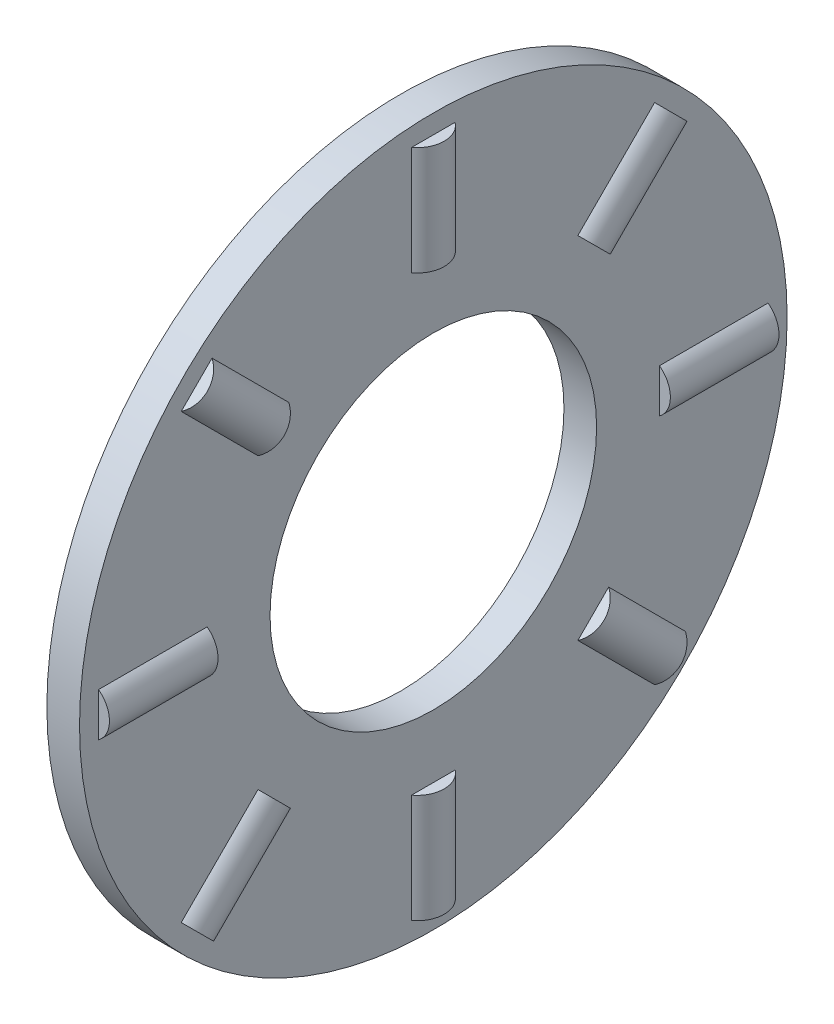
ISO-10303-21;
HEADER;
FILE_DESCRIPTION(('STEP AP214'),'2;1');
FILE_NAME('part.step','',(''),(''),'','','');
FILE_SCHEMA(('AUTOMOTIVE_DESIGN { 1 0 10303 214 1 1 1 1 }'));
ENDSEC;
DATA;
#1=APPLICATION_CONTEXT('core data for automotive mechanical design processes');
#2=APPLICATION_PROTOCOL_DEFINITION('international standard','automotive_design',2000,#1);
#3=PRODUCT_CONTEXT('',#1,'mechanical');
#4=PRODUCT('Part','Part','',(#3));
#5=PRODUCT_RELATED_PRODUCT_CATEGORY('part','',(#4));
#6=PRODUCT_DEFINITION_FORMATION('','',#4);
#7=PRODUCT_DEFINITION_CONTEXT('part definition',#1,'design');
#8=PRODUCT_DEFINITION('design','',#6,#7);
#9=PRODUCT_DEFINITION_SHAPE('','',#8);
#10=(LENGTH_UNIT() NAMED_UNIT(*) SI_UNIT(.MILLI.,.METRE.));
#11=(NAMED_UNIT(*) PLANE_ANGLE_UNIT() SI_UNIT($,.RADIAN.));
#12=(NAMED_UNIT(*) SI_UNIT($,.STERADIAN.) SOLID_ANGLE_UNIT());
#13=UNCERTAINTY_MEASURE_WITH_UNIT(LENGTH_MEASURE(1.E-05),#10,'distance_accuracy_value','');
#14=(GEOMETRIC_REPRESENTATION_CONTEXT(3) GLOBAL_UNCERTAINTY_ASSIGNED_CONTEXT((#13)) GLOBAL_UNIT_ASSIGNED_CONTEXT((#10,
#11,#12)) REPRESENTATION_CONTEXT('',''));
#15=CARTESIAN_POINT('',(0.,0.,0.));
#16=DIRECTION('',(0.,0.,1.));
#17=DIRECTION('',(1.,0.,0.));
#18=AXIS2_PLACEMENT_3D('',#15,#16,#17);
#19=CARTESIAN_POINT('',(0.5,5.87605735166,5.87605735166));
#20=DIRECTION('',(0.,-0.707106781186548,-0.707106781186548));
#21=DIRECTION('',(0.,0.707106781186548,-0.707106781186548));
#22=AXIS2_PLACEMENT_3D('',#19,#20,#21);
#23=PLANE('',#22);
#24=CARTESIAN_POINT('',(1.,5.87605735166,5.87605735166));
#25=DIRECTION('',(0.,-0.707106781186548,-0.707106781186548));
#26=DIRECTION('',(0.,0.707106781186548,-0.707106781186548));
#27=AXIS2_PLACEMENT_3D('',#24,#25,#26);
#28=CIRCLE('',#27,1.);
#29=CARTESIAN_POINT('',(1.,6.58316413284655,5.16895057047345));
#30=VERTEX_POINT('',#29);
#31=EDGE_CURVE('P0_E17',#30,#30,#28,.F.);
#32=ORIENTED_EDGE('',*,*,#31,.F.);
#33=EDGE_LOOP('',(#32));
#34=FACE_BOUND('',#33,.T.);
#35=ADVANCED_FACE('P0_F14',(#34),#23,.T.);
#36=CARTESIAN_POINT('',(0.5,8.69741340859,8.69741340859));
#37=DIRECTION('',(0.,0.707106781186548,0.707106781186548));
#38=DIRECTION('',(0.,-0.707106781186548,0.707106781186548));
#39=AXIS2_PLACEMENT_3D('',#36,#37,#38);
#40=PLANE('',#39);
#41=CARTESIAN_POINT('',(1.,8.69741340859,8.69741340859));
#42=DIRECTION('',(0.,-0.707106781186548,-0.707106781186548));
#43=DIRECTION('',(0.,0.707106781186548,-0.707106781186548));
#44=AXIS2_PLACEMENT_3D('',#41,#42,#43);
#45=CIRCLE('',#44,1.);
#46=CARTESIAN_POINT('',(1.,9.40452018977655,7.99030662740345));
#47=VERTEX_POINT('',#46);
#48=EDGE_CURVE('P0_E10',#47,#47,#45,.T.);
#49=ORIENTED_EDGE('',*,*,#48,.F.);
#50=EDGE_LOOP('',(#49));
#51=FACE_BOUND('',#50,.T.);
#52=ADVANCED_FACE('P0_F29',(#51),#40,.T.);
#53=CARTESIAN_POINT('',(1.,7.28673538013,7.28673538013));
#54=DIRECTION('',(0.,-0.707106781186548,-0.707106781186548));
#55=DIRECTION('',(0.,0.707106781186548,-0.707106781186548));
#56=AXIS2_PLACEMENT_3D('',#53,#54,#55);
#57=CYLINDRICAL_SURFACE('',#56,1.);
#58=ORIENTED_EDGE('',*,*,#31,.T.);
#59=EDGE_LOOP('',(#58));
#60=FACE_BOUND('',#59,.T.);
#61=ORIENTED_EDGE('',*,*,#48,.T.);
#62=EDGE_LOOP('',(#61));
#63=FACE_BOUND('',#62,.T.);
#64=ADVANCED_FACE('P0_F26',(#60,#63),#57,.T.);
#65=CLOSED_SHELL('',(#35,#52,#64));
#66=MANIFOLD_SOLID_BREP('P0_B1',#65);
#67=CARTESIAN_POINT('',(0.5,12.3,0.));
#68=DIRECTION('',(0.,1.,0.));
#69=DIRECTION('',(0.,0.,1.));
#70=AXIS2_PLACEMENT_3D('',#67,#68,#69);
#71=PLANE('',#70);
#72=CARTESIAN_POINT('',(1.,12.2999999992,0.));
#73=DIRECTION('',(0.,-1.,0.));
#74=DIRECTION('',(0.,0.,-1.));
#75=AXIS2_PLACEMENT_3D('',#72,#73,#74);
#76=CIRCLE('',#75,1.);
#77=CARTESIAN_POINT('',(1.,12.2999999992,-1.));
#78=VERTEX_POINT('',#77);
#79=EDGE_CURVE('P1_E17',#78,#78,#76,.T.);
#80=ORIENTED_EDGE('',*,*,#79,.F.);
#81=EDGE_LOOP('',(#80));
#82=FACE_BOUND('',#81,.T.);
#83=ADVANCED_FACE('P1_F14',(#82),#71,.T.);
#84=CARTESIAN_POINT('',(0.5,8.31,0.));
#85=DIRECTION('',(0.,-1.,0.));
#86=DIRECTION('',(0.,0.,-1.));
#87=AXIS2_PLACEMENT_3D('',#84,#85,#86);
#88=PLANE('',#87);
#89=CARTESIAN_POINT('',(1.,8.31000000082,0.));
#90=DIRECTION('',(0.,-1.,0.));
#91=DIRECTION('',(0.,0.,-1.));
#92=AXIS2_PLACEMENT_3D('',#89,#90,#91);
#93=CIRCLE('',#92,1.);
#94=CARTESIAN_POINT('',(1.,8.31000000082,-1.));
#95=VERTEX_POINT('',#94);
#96=EDGE_CURVE('P1_E10',#95,#95,#93,.F.);
#97=ORIENTED_EDGE('',*,*,#96,.F.);
#98=EDGE_LOOP('',(#97));
#99=FACE_BOUND('',#98,.T.);
#100=ADVANCED_FACE('P1_F29',(#99),#88,.T.);
#101=CARTESIAN_POINT('',(1.,10.305,0.));
#102=DIRECTION('',(0.,-1.,0.));
#103=DIRECTION('',(0.,0.,-1.));
#104=AXIS2_PLACEMENT_3D('',#101,#102,#103);
#105=CYLINDRICAL_SURFACE('',#104,1.);
#106=ORIENTED_EDGE('',*,*,#79,.T.);
#107=EDGE_LOOP('',(#106));
#108=FACE_BOUND('',#107,.T.);
#109=ORIENTED_EDGE('',*,*,#96,.T.);
#110=EDGE_LOOP('',(#109));
#111=FACE_BOUND('',#110,.T.);
#112=ADVANCED_FACE('P1_F26',(#108,#111),#105,.T.);
#113=CLOSED_SHELL('',(#83,#100,#112));
#114=MANIFOLD_SOLID_BREP('P1_B1',#113);
#115=CARTESIAN_POINT('',(0.5,-5.87605735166,5.87605735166));
#116=DIRECTION('',(0.,0.707106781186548,-0.707106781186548));
#117=DIRECTION('',(0.,0.707106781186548,0.707106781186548));
#118=AXIS2_PLACEMENT_3D('',#115,#116,#117);
#119=PLANE('',#118);
#120=CARTESIAN_POINT('',(1.,-5.87605735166,5.87605735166));
#121=DIRECTION('',(0.,0.707106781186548,-0.707106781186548));
#122=DIRECTION('',(0.,0.707106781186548,0.707106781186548));
#123=AXIS2_PLACEMENT_3D('',#120,#121,#122);
#124=CIRCLE('',#123,1.);
#125=CARTESIAN_POINT('',(1.,-5.16895057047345,6.58316413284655));
#126=VERTEX_POINT('',#125);
#127=EDGE_CURVE('P2_E17',#126,#126,#124,.F.);
#128=ORIENTED_EDGE('',*,*,#127,.F.);
#129=EDGE_LOOP('',(#128));
#130=FACE_BOUND('',#129,.T.);
#131=ADVANCED_FACE('P2_F14',(#130),#119,.T.);
#132=CARTESIAN_POINT('',(0.5,-8.69741340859,8.69741340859));
#133=DIRECTION('',(0.,-0.707106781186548,0.707106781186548));
#134=DIRECTION('',(0.,-0.707106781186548,-0.707106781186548));
#135=AXIS2_PLACEMENT_3D('',#132,#133,#134);
#136=PLANE('',#135);
#137=CARTESIAN_POINT('',(1.,-8.69741340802,8.69741340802));
#138=DIRECTION('',(0.,0.707106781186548,-0.707106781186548));
#139=DIRECTION('',(0.,0.707106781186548,0.707106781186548));
#140=AXIS2_PLACEMENT_3D('',#137,#138,#139);
#141=CIRCLE('',#140,1.);
#142=CARTESIAN_POINT('',(1.,-7.99030662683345,9.40452018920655));
#143=VERTEX_POINT('',#142);
#144=EDGE_CURVE('P2_E10',#143,#143,#141,.T.);
#145=ORIENTED_EDGE('',*,*,#144,.F.);
#146=EDGE_LOOP('',(#145));
#147=FACE_BOUND('',#146,.T.);
#148=ADVANCED_FACE('P2_F29',(#147),#136,.T.);
#149=CARTESIAN_POINT('',(1.,-7.28673538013,7.28673538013));
#150=DIRECTION('',(0.,0.707106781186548,-0.707106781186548));
#151=DIRECTION('',(0.,0.707106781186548,0.707106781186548));
#152=AXIS2_PLACEMENT_3D('',#149,#150,#151);
#153=CYLINDRICAL_SURFACE('',#152,1.);
#154=ORIENTED_EDGE('',*,*,#127,.T.);
#155=EDGE_LOOP('',(#154));
#156=FACE_BOUND('',#155,.T.);
#157=ORIENTED_EDGE('',*,*,#144,.T.);
#158=EDGE_LOOP('',(#157));
#159=FACE_BOUND('',#158,.T.);
#160=ADVANCED_FACE('P2_F26',(#156,#159),#153,.T.);
#161=CLOSED_SHELL('',(#131,#148,#160));
#162=MANIFOLD_SOLID_BREP('P2_B1',#161);
#163=CARTESIAN_POINT('',(0.5,-5.87605735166,-5.87605735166));
#164=DIRECTION('',(0.,0.707106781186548,0.707106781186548));
#165=DIRECTION('',(0.,-0.707106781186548,0.707106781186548));
#166=AXIS2_PLACEMENT_3D('',#163,#164,#165);
#167=PLANE('',#166);
#168=CARTESIAN_POINT('',(1.,-5.87605735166,-5.87605735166));
#169=DIRECTION('',(0.,0.707106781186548,0.707106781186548));
#170=DIRECTION('',(0.,-0.707106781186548,0.707106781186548));
#171=AXIS2_PLACEMENT_3D('',#168,#169,#170);
#172=CIRCLE('',#171,1.);
#173=CARTESIAN_POINT('',(1.,-6.58316413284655,-5.16895057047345));
#174=VERTEX_POINT('',#173);
#175=EDGE_CURVE('P3_E17',#174,#174,#172,.F.);
#176=ORIENTED_EDGE('',*,*,#175,.F.);
#177=EDGE_LOOP('',(#176));
#178=FACE_BOUND('',#177,.T.);
#179=ADVANCED_FACE('P3_F14',(#178),#167,.T.);
#180=CARTESIAN_POINT('',(0.5,-8.69741340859,-8.69741340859));
#181=DIRECTION('',(0.,-0.707106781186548,-0.707106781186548));
#182=DIRECTION('',(0.,0.707106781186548,-0.707106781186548));
#183=AXIS2_PLACEMENT_3D('',#180,#181,#182);
#184=PLANE('',#183);
#185=CARTESIAN_POINT('',(1.,-8.69741340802,-8.69741340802));
#186=DIRECTION('',(0.,0.707106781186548,0.707106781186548));
#187=DIRECTION('',(0.,-0.707106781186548,0.707106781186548));
#188=AXIS2_PLACEMENT_3D('',#185,#186,#187);
#189=CIRCLE('',#188,1.);
#190=CARTESIAN_POINT('',(1.,-9.40452018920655,-7.99030662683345));
#191=VERTEX_POINT('',#190);
#192=EDGE_CURVE('P3_E10',#191,#191,#189,.T.);
#193=ORIENTED_EDGE('',*,*,#192,.F.);
#194=EDGE_LOOP('',(#193));
#195=FACE_BOUND('',#194,.T.);
#196=ADVANCED_FACE('P3_F29',(#195),#184,.T.);
#197=CARTESIAN_POINT('',(1.,-7.28673538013,-7.28673538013));
#198=DIRECTION('',(0.,0.707106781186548,0.707106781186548));
#199=DIRECTION('',(0.,-0.707106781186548,0.707106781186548));
#200=AXIS2_PLACEMENT_3D('',#197,#198,#199);
#201=CYLINDRICAL_SURFACE('',#200,1.);
#202=ORIENTED_EDGE('',*,*,#175,.T.);
#203=EDGE_LOOP('',(#202));
#204=FACE_BOUND('',#203,.T.);
#205=ORIENTED_EDGE('',*,*,#192,.T.);
#206=EDGE_LOOP('',(#205));
#207=FACE_BOUND('',#206,.T.);
#208=ADVANCED_FACE('P3_F26',(#204,#207),#201,.T.);
#209=CLOSED_SHELL('',(#179,#196,#208));
#210=MANIFOLD_SOLID_BREP('P3_B1',#209);
#211=CARTESIAN_POINT('',(1.6,9.5,0.));
#212=DIRECTION('',(1.,0.,0.));
#213=DIRECTION('',(0.,0.,-1.));
#214=AXIS2_PLACEMENT_3D('',#211,#212,#213);
#215=PLANE('',#214);
#216=CARTESIAN_POINT('',(1.59999999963,0.,0.));
#217=DIRECTION('',(-1.,0.,0.));
#218=DIRECTION('',(0.,0.,1.));
#219=AXIS2_PLACEMENT_3D('',#216,#217,#218);
#220=CIRCLE('',#219,6.);
#221=CARTESIAN_POINT('',(1.59999999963,0.,6.));
#222=VERTEX_POINT('',#221);
#223=EDGE_CURVE('P4_E339',#222,#222,#220,.T.);
#224=ORIENTED_EDGE('',*,*,#223,.T.);
#225=EDGE_LOOP('',(#224));
#226=FACE_BOUND('',#225,.T.);
#227=DIRECTION('',(0.,0.,-1.));
#228=VECTOR('',#227,1.);
#229=CARTESIAN_POINT('',(1.59999999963,8.31,0.));
#230=LINE('',#229,#228);
#231=CARTESIAN_POINT('',(1.5999999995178,8.31,-0.80000000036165));
#232=VERTEX_POINT('',#231);
#233=CARTESIAN_POINT('',(1.5999999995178,8.31,0.80000000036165));
#234=VERTEX_POINT('',#233);
#235=EDGE_CURVE('P4_E333',#232,#234,#230,.F.);
#236=ORIENTED_EDGE('',*,*,#235,.T.);
#237=DIRECTION('',(0.,-1.,0.));
#238=VECTOR('',#237,1.);
#239=CARTESIAN_POINT('',(1.5999999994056,10.305,0.8000000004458));
#240=LINE('',#239,#238);
#241=CARTESIAN_POINT('',(1.5999999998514,12.2999999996,0.8000000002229));
#242=VERTEX_POINT('',#241);
#243=EDGE_CURVE('P4_E329',#234,#242,#240,.F.);
#244=ORIENTED_EDGE('',*,*,#243,.T.);
#245=DIRECTION('',(0.,0.,1.));
#246=VECTOR('',#245,1.);
#247=CARTESIAN_POINT('',(1.6,12.3,0.));
#248=LINE('',#247,#246);
#249=CARTESIAN_POINT('',(1.5999999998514,12.2999999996,-0.8000000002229));
#250=VERTEX_POINT('',#249);
#251=EDGE_CURVE('P4_E330',#242,#250,#248,.F.);
#252=ORIENTED_EDGE('',*,*,#251,.T.);
#253=DIRECTION('',(0.,-1.,0.));
#254=VECTOR('',#253,1.);
#255=CARTESIAN_POINT('',(1.5999999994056,10.305,-0.8000000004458));
#256=LINE('',#255,#254);
#257=EDGE_CURVE('P4_E338',#250,#232,#256,.T.);
#258=ORIENTED_EDGE('',*,*,#257,.T.);
#259=EDGE_LOOP('',(#236,#244,#252,#258));
#260=FACE_BOUND('',#259,.T.);
#261=DIRECTION('',(0.,0.,-1.));
#262=VECTOR('',#261,1.);
#263=CARTESIAN_POINT('',(1.59999999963,-12.3,0.));
#264=LINE('',#263,#262);
#265=CARTESIAN_POINT('',(1.5999999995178,-12.3,-0.80000000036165));
#266=VERTEX_POINT('',#265);
#267=CARTESIAN_POINT('',(1.5999999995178,-12.3,0.80000000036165));
#268=VERTEX_POINT('',#267);
#269=EDGE_CURVE('P4_E320',#266,#268,#264,.F.);
#270=ORIENTED_EDGE('',*,*,#269,.T.);
#271=DIRECTION('',(0.,-1.,0.));
#272=VECTOR('',#271,1.);
#273=CARTESIAN_POINT('',(1.5999999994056,-10.305,0.8000000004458));
#274=LINE('',#273,#272);
#275=CARTESIAN_POINT('',(1.5999999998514,-8.31000000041,0.8000000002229));
#276=VERTEX_POINT('',#275);
#277=EDGE_CURVE('P4_E316',#268,#276,#274,.F.);
#278=ORIENTED_EDGE('',*,*,#277,.T.);
#279=DIRECTION('',(0.,0.,1.));
#280=VECTOR('',#279,1.);
#281=CARTESIAN_POINT('',(1.6,-8.31,0.));
#282=LINE('',#281,#280);
#283=CARTESIAN_POINT('',(1.5999999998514,-8.31000000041,-0.8000000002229));
#284=VERTEX_POINT('',#283);
#285=EDGE_CURVE('P4_E317',#276,#284,#282,.F.);
#286=ORIENTED_EDGE('',*,*,#285,.T.);
#287=DIRECTION('',(0.,-1.,0.));
#288=VECTOR('',#287,1.);
#289=CARTESIAN_POINT('',(1.5999999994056,-10.305,-0.8000000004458));
#290=LINE('',#289,#288);
#291=EDGE_CURVE('P4_E326',#284,#266,#290,.T.);
#292=ORIENTED_EDGE('',*,*,#291,.T.);
#293=EDGE_LOOP('',(#270,#278,#286,#292));
#294=FACE_BOUND('',#293,.T.);
#295=DIRECTION('',(0.,0.707106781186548,-0.707106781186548));
#296=VECTOR('',#295,1.);
#297=CARTESIAN_POINT('',(1.59999999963,5.87605735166,5.87605735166));
#298=LINE('',#297,#296);
#299=CARTESIAN_POINT('',(1.59999999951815,6.44174277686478,5.31037192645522));
#300=VERTEX_POINT('',#299);
#301=CARTESIAN_POINT('',(1.59999999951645,5.31037192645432,6.44174277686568));
#302=VERTEX_POINT('',#301);
#303=EDGE_CURVE('P4_E307',#300,#302,#298,.F.);
#304=ORIENTED_EDGE('',*,*,#303,.T.);
#305=DIRECTION('',(0.,-0.707106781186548,-0.707106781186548));
#306=VECTOR('',#305,1.);
#307=CARTESIAN_POINT('',(1.59999999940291,6.7210499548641,7.85242080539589));
#308=LINE('',#307,#306);
#309=CARTESIAN_POINT('',(1.59999999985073,8.13172798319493,9.26309883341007));
#310=VERTEX_POINT('',#309);
#311=EDGE_CURVE('P4_E303',#302,#310,#308,.F.);
#312=ORIENTED_EDGE('',*,*,#311,.T.);
#313=DIRECTION('',(0.,-0.707106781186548,0.707106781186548));
#314=VECTOR('',#313,1.);
#315=CARTESIAN_POINT('',(1.6,8.69741340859,8.69741340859));
#316=LINE('',#315,#314);
#317=CARTESIAN_POINT('',(1.59999999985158,9.26309883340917,8.13172798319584));
#318=VERTEX_POINT('',#317);
#319=EDGE_CURVE('P4_E304',#310,#318,#316,.F.);
#320=ORIENTED_EDGE('',*,*,#319,.T.);
#321=DIRECTION('',(0.,-0.707106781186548,-0.707106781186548));
#322=VECTOR('',#321,1.);
#323=CARTESIAN_POINT('',(1.5999999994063,7.85242080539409,6.72104995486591));
#324=LINE('',#323,#322);
#325=EDGE_CURVE('P4_E313',#318,#300,#324,.T.);
#326=ORIENTED_EDGE('',*,*,#325,.T.);
#327=EDGE_LOOP('',(#304,#312,#320,#326));
#328=FACE_BOUND('',#327,.T.);
#329=DIRECTION('',(0.,0.707106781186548,-0.707106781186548));
#330=VECTOR('',#329,1.);
#331=CARTESIAN_POINT('',(1.59999999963,-8.69741340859,-8.69741340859));
#332=LINE('',#331,#330);
#333=CARTESIAN_POINT('',(1.59999999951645,-8.13172798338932,-9.26309883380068));
#334=VERTEX_POINT('',#333);
#335=CARTESIAN_POINT('',(1.59999999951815,-9.26309883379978,-8.13172798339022));
#336=VERTEX_POINT('',#335);
#337=EDGE_CURVE('P4_E294',#334,#336,#332,.F.);
#338=ORIENTED_EDGE('',*,*,#337,.T.);
#339=DIRECTION('',(0.,-0.707106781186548,-0.707106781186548));
#340=VECTOR('',#339,1.);
#341=CARTESIAN_POINT('',(1.5999999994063,-7.85242080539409,-6.72104995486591));
#342=LINE('',#341,#340);
#343=CARTESIAN_POINT('',(1.59999999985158,-6.44174277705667,-5.31037192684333));
#344=VERTEX_POINT('',#343);
#345=EDGE_CURVE('P4_E290',#336,#344,#342,.F.);
#346=ORIENTED_EDGE('',*,*,#345,.T.);
#347=DIRECTION('',(0.,-0.707106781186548,0.707106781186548));
#348=VECTOR('',#347,1.);
#349=CARTESIAN_POINT('',(1.6,-5.87605735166,-5.87605735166));
#350=LINE('',#349,#348);
#351=CARTESIAN_POINT('',(1.59999999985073,-5.31037192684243,-6.44174277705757));
#352=VERTEX_POINT('',#351);
#353=EDGE_CURVE('P4_E291',#344,#352,#350,.F.);
#354=ORIENTED_EDGE('',*,*,#353,.T.);
#355=DIRECTION('',(0.,-0.707106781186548,-0.707106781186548));
#356=VECTOR('',#355,1.);
#357=CARTESIAN_POINT('',(1.59999999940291,-6.7210499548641,-7.85242080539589));
#358=LINE('',#357,#356);
#359=EDGE_CURVE('P4_E300',#352,#334,#358,.T.);
#360=ORIENTED_EDGE('',*,*,#359,.T.);
#361=EDGE_LOOP('',(#338,#346,#354,#360));
#362=FACE_BOUND('',#361,.T.);
#363=DIRECTION('',(0.,1.,0.));
#364=VECTOR('',#363,1.);
#365=CARTESIAN_POINT('',(1.59999999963,0.,8.31));
#366=LINE('',#365,#364);
#367=CARTESIAN_POINT('',(1.5999999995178,0.800000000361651,8.31));
#368=VERTEX_POINT('',#367);
#369=CARTESIAN_POINT('',(1.5999999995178,-0.800000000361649,8.31));
#370=VERTEX_POINT('',#369);
#371=EDGE_CURVE('P4_E281',#368,#370,#366,.F.);
#372=ORIENTED_EDGE('',*,*,#371,.T.);
#373=DIRECTION('',(0.,0.,-1.));
#374=VECTOR('',#373,1.);
#375=CARTESIAN_POINT('',(1.5999999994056,-0.800000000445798,10.305));
#376=LINE('',#375,#374);
#377=CARTESIAN_POINT('',(1.5999999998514,-0.800000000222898,12.2999999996));
#378=VERTEX_POINT('',#377);
#379=EDGE_CURVE('P4_E277',#370,#378,#376,.F.);
#380=ORIENTED_EDGE('',*,*,#379,.T.);
#381=DIRECTION('',(0.,-1.,0.));
#382=VECTOR('',#381,1.);
#383=CARTESIAN_POINT('',(1.6,0.,12.3));
#384=LINE('',#383,#382);
#385=CARTESIAN_POINT('',(1.5999999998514,0.800000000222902,12.2999999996));
#386=VERTEX_POINT('',#385);
#387=EDGE_CURVE('P4_E278',#378,#386,#384,.F.);
#388=ORIENTED_EDGE('',*,*,#387,.T.);
#389=DIRECTION('',(0.,0.,-1.));
#390=VECTOR('',#389,1.);
#391=CARTESIAN_POINT('',(1.5999999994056,0.800000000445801,10.305));
#392=LINE('',#391,#390);
#393=EDGE_CURVE('P4_E287',#386,#368,#392,.T.);
#394=ORIENTED_EDGE('',*,*,#393,.T.);
#395=EDGE_LOOP('',(#372,#380,#388,#394));
#396=FACE_BOUND('',#395,.T.);
#397=DIRECTION('',(0.,1.,0.));
#398=VECTOR('',#397,1.);
#399=CARTESIAN_POINT('',(1.59999999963,0.,-12.3));
#400=LINE('',#399,#398);
#401=CARTESIAN_POINT('',(1.5999999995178,0.800000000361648,-12.3));
#402=VERTEX_POINT('',#401);
#403=CARTESIAN_POINT('',(1.5999999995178,-0.800000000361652,-12.3));
#404=VERTEX_POINT('',#403);
#405=EDGE_CURVE('P4_E268',#402,#404,#400,.F.);
#406=ORIENTED_EDGE('',*,*,#405,.T.);
#407=DIRECTION('',(0.,0.,-1.));
#408=VECTOR('',#407,1.);
#409=CARTESIAN_POINT('',(1.5999999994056,-0.800000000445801,-10.305));
#410=LINE('',#409,#408);
#411=CARTESIAN_POINT('',(1.5999999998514,-0.800000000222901,-8.31000000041));
#412=VERTEX_POINT('',#411);
#413=EDGE_CURVE('P4_E264',#404,#412,#410,.F.);
#414=ORIENTED_EDGE('',*,*,#413,.T.);
#415=DIRECTION('',(0.,-1.,0.));
#416=VECTOR('',#415,1.);
#417=CARTESIAN_POINT('',(1.6,0.,-8.31));
#418=LINE('',#417,#416);
#419=CARTESIAN_POINT('',(1.5999999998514,0.800000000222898,-8.31000000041));
#420=VERTEX_POINT('',#419);
#421=EDGE_CURVE('P4_E265',#412,#420,#418,.F.);
#422=ORIENTED_EDGE('',*,*,#421,.T.);
#423=DIRECTION('',(0.,0.,-1.));
#424=VECTOR('',#423,1.);
#425=CARTESIAN_POINT('',(1.5999999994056,0.800000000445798,-10.305));
#426=LINE('',#425,#424);
#427=EDGE_CURVE('P4_E274',#420,#402,#426,.T.);
#428=ORIENTED_EDGE('',*,*,#427,.T.);
#429=EDGE_LOOP('',(#406,#414,#422,#428));
#430=FACE_BOUND('',#429,.T.);
#431=DIRECTION('',(0.,0.707106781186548,0.707106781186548));
#432=VECTOR('',#431,1.);
#433=CARTESIAN_POINT('',(1.59999999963,-5.87605735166,5.87605735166));
#434=LINE('',#433,#432);
#435=CARTESIAN_POINT('',(1.59999999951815,-5.31037192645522,6.44174277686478));
#436=VERTEX_POINT('',#435);
#437=CARTESIAN_POINT('',(1.59999999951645,-6.44174277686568,5.31037192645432));
#438=VERTEX_POINT('',#437);
#439=EDGE_CURVE('P4_E255',#436,#438,#434,.F.);
#440=ORIENTED_EDGE('',*,*,#439,.T.);
#441=DIRECTION('',(0.,0.707106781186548,-0.707106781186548));
#442=VECTOR('',#441,1.);
#443=CARTESIAN_POINT('',(1.59999999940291,-7.85242080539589,6.7210499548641));
#444=LINE('',#443,#442);
#445=CARTESIAN_POINT('',(1.59999999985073,-9.26309883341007,8.13172798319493));
#446=VERTEX_POINT('',#445);
#447=EDGE_CURVE('P4_E251',#438,#446,#444,.F.);
#448=ORIENTED_EDGE('',*,*,#447,.T.);
#449=DIRECTION('',(0.,-0.707106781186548,-0.707106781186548));
#450=VECTOR('',#449,1.);
#451=CARTESIAN_POINT('',(1.6,-8.69741340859,8.69741340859));
#452=LINE('',#451,#450);
#453=CARTESIAN_POINT('',(1.59999999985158,-8.13172798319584,9.26309883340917));
#454=VERTEX_POINT('',#453);
#455=EDGE_CURVE('P4_E252',#446,#454,#452,.F.);
#456=ORIENTED_EDGE('',*,*,#455,.T.);
#457=DIRECTION('',(0.,0.707106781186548,-0.707106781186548));
#458=VECTOR('',#457,1.);
#459=CARTESIAN_POINT('',(1.5999999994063,-6.72104995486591,7.85242080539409));
#460=LINE('',#459,#458);
#461=EDGE_CURVE('P4_E261',#454,#436,#460,.T.);
#462=ORIENTED_EDGE('',*,*,#461,.T.);
#463=EDGE_LOOP('',(#440,#448,#456,#462));
#464=FACE_BOUND('',#463,.T.);
#465=DIRECTION('',(0.,0.707106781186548,0.707106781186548));
#466=VECTOR('',#465,1.);
#467=CARTESIAN_POINT('',(1.59999999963,8.69741340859,-8.69741340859));
#468=LINE('',#467,#466);
#469=CARTESIAN_POINT('',(1.59999999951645,9.26309883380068,-8.13172798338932));
#470=VERTEX_POINT('',#469);
#471=CARTESIAN_POINT('',(1.59999999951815,8.13172798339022,-9.26309883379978));
#472=VERTEX_POINT('',#471);
#473=EDGE_CURVE('P4_E234',#470,#472,#468,.F.);
#474=ORIENTED_EDGE('',*,*,#473,.T.);
#475=DIRECTION('',(0.,0.707106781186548,-0.707106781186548));
#476=VECTOR('',#475,1.);
#477=CARTESIAN_POINT('',(1.5999999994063,6.72104995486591,-7.85242080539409));
#478=LINE('',#477,#476);
#479=CARTESIAN_POINT('',(1.59999999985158,5.31037192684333,-6.44174277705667));
#480=VERTEX_POINT('',#479);
#481=EDGE_CURVE('P4_E232',#472,#480,#478,.F.);
#482=ORIENTED_EDGE('',*,*,#481,.T.);
#483=DIRECTION('',(0.,-0.707106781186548,-0.707106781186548));
#484=VECTOR('',#483,1.);
#485=CARTESIAN_POINT('',(1.6,5.87605735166,-5.87605735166));
#486=LINE('',#485,#484);
#487=CARTESIAN_POINT('',(1.59999999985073,6.44174277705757,-5.31037192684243));
#488=VERTEX_POINT('',#487);
#489=EDGE_CURVE('P4_E219',#480,#488,#486,.F.);
#490=ORIENTED_EDGE('',*,*,#489,.T.);
#491=DIRECTION('',(0.,0.707106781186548,-0.707106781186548));
#492=VECTOR('',#491,1.);
#493=CARTESIAN_POINT('',(1.59999999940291,7.85242080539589,-6.7210499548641));
#494=LINE('',#493,#492);
#495=EDGE_CURVE('P4_E248',#488,#470,#494,.T.);
#496=ORIENTED_EDGE('',*,*,#495,.T.);
#497=EDGE_LOOP('',(#474,#482,#490,#496));
#498=FACE_BOUND('',#497,.T.);
#499=CARTESIAN_POINT('',(1.59999999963,0.,0.));
#500=DIRECTION('',(-1.,0.,0.));
#501=DIRECTION('',(0.,0.,1.));
#502=AXIS2_PLACEMENT_3D('',#499,#500,#501);
#503=CIRCLE('',#502,13.);
#504=CARTESIAN_POINT('',(1.59999999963,0.,13.));
#505=VERTEX_POINT('',#504);
#506=EDGE_CURVE('P4_E19',#505,#505,#503,.T.);
#507=ORIENTED_EDGE('',*,*,#506,.F.);
#508=EDGE_LOOP('',(#507));
#509=FACE_BOUND('',#508,.T.);
#510=ADVANCED_FACE('P4_F16',(#226,#260,#294,#328,#362,#396,#430,#464,#498,#509),#215,.T.);
#511=CARTESIAN_POINT('',(1.,0.,0.));
#512=DIRECTION('',(-1.,0.,0.));
#513=DIRECTION('',(0.,0.,1.));
#514=AXIS2_PLACEMENT_3D('',#511,#512,#513);
#515=CYLINDRICAL_SURFACE('',#514,13.);
#516=CARTESIAN_POINT('',(0.400000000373,0.,0.));
#517=DIRECTION('',(-1.,0.,0.));
#518=DIRECTION('',(0.,0.,1.));
#519=AXIS2_PLACEMENT_3D('',#516,#517,#518);
#520=CIRCLE('',#519,13.);
#521=CARTESIAN_POINT('',(0.400000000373,0.,13.));
#522=VERTEX_POINT('',#521);
#523=EDGE_CURVE('P4_E342',#522,#522,#520,.T.);
#524=ORIENTED_EDGE('',*,*,#523,.F.);
#525=EDGE_LOOP('',(#524));
#526=FACE_BOUND('',#525,.T.);
#527=ORIENTED_EDGE('',*,*,#506,.T.);
#528=EDGE_LOOP('',(#527));
#529=FACE_BOUND('',#528,.T.);
#530=ADVANCED_FACE('P4_F527',(#526,#529),#515,.T.);
#531=CARTESIAN_POINT('',(0.5,5.87605735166,-5.87605735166));
#532=DIRECTION('',(0.,-0.707106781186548,0.707106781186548));
#533=DIRECTION('',(0.,-0.707106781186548,-0.707106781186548));
#534=AXIS2_PLACEMENT_3D('',#531,#532,#533);
#535=PLANE('',#534);
#536=CARTESIAN_POINT('',(1.,5.87605735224,-5.87605735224));
#537=DIRECTION('',(0.,0.707106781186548,-0.707106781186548));
#538=DIRECTION('',(0.,0.707106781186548,0.707106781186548));
#539=AXIS2_PLACEMENT_3D('',#536,#537,#538);
#540=CIRCLE('',#539,1.);
#541=CARTESIAN_POINT('',(0.4,5.31037192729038,-6.44174277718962));
#542=VERTEX_POINT('',#541);
#543=EDGE_CURVE('P4_E223',#480,#542,#540,.T.);
#544=ORIENTED_EDGE('',*,*,#543,.T.);
#545=DIRECTION('',(0.,-0.707106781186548,-0.707106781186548));
#546=VECTOR('',#545,1.);
#547=CARTESIAN_POINT('',(0.4,6.44174277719,-5.31037192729));
#548=LINE('',#547,#546);
#549=CARTESIAN_POINT('',(0.400000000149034,6.44174277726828,-5.31037192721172));
#550=VERTEX_POINT('',#549);
#551=EDGE_CURVE('P4_E344',#550,#542,#548,.T.);
#552=ORIENTED_EDGE('',*,*,#551,.F.);
#553=CARTESIAN_POINT('',(1.,5.87605735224,-5.87605735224));
#554=DIRECTION('',(0.,0.707106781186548,-0.707106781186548));
#555=DIRECTION('',(0.,0.707106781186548,0.707106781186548));
#556=AXIS2_PLACEMENT_3D('',#553,#554,#555);
#557=CIRCLE('',#556,1.);
#558=EDGE_CURVE('P4_E226',#550,#488,#557,.T.);
#559=ORIENTED_EDGE('',*,*,#558,.T.);
#560=ORIENTED_EDGE('',*,*,#489,.F.);
#561=EDGE_LOOP('',(#544,#552,#559,#560));
#562=FACE_BOUND('',#561,.T.);
#563=ADVANCED_FACE('P4_F221',(#562),#535,.F.);
#564=CARTESIAN_POINT('',(1.,7.28673538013,-7.28673538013));
#565=DIRECTION('',(0.,0.707106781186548,-0.707106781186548));
#566=DIRECTION('',(0.,0.707106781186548,0.707106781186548));
#567=AXIS2_PLACEMENT_3D('',#564,#565,#566);
#568=CYLINDRICAL_SURFACE('',#567,1.);
#569=CARTESIAN_POINT('',(1.,8.697413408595,-8.697413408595));
#570=DIRECTION('',(0.,0.707106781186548,-0.707106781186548));
#571=DIRECTION('',(0.,0.707106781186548,0.707106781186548));
#572=AXIS2_PLACEMENT_3D('',#569,#570,#571);
#573=CIRCLE('',#572,1.);
#574=CARTESIAN_POINT('',(0.4,8.13172798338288,-9.26309883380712));
#575=VERTEX_POINT('',#574);
#576=EDGE_CURVE('P4_E237',#472,#575,#573,.T.);
#577=ORIENTED_EDGE('',*,*,#576,.T.);
#578=DIRECTION('',(0.,0.707106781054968,-0.707106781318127));
#579=VECTOR('',#578,1.);
#580=CARTESIAN_POINT('',(0.4,5.31037192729,-6.44174277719));
#581=LINE('',#580,#579);
#582=EDGE_CURVE('P4_E241',#542,#575,#581,.T.);
#583=ORIENTED_EDGE('',*,*,#582,.F.);
#584=ORIENTED_EDGE('',*,*,#543,.F.);
#585=ORIENTED_EDGE('',*,*,#481,.F.);
#586=EDGE_LOOP('',(#577,#583,#584,#585));
#587=FACE_BOUND('',#586,.T.);
#588=ADVANCED_FACE('P4_F239',(#587),#568,.F.);
#589=CARTESIAN_POINT('',(0.5,8.69741340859,-8.69741340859));
#590=DIRECTION('',(0.,0.707106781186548,-0.707106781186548));
#591=DIRECTION('',(0.,0.707106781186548,0.707106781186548));
#592=AXIS2_PLACEMENT_3D('',#589,#590,#591);
#593=PLANE('',#592);
#594=CARTESIAN_POINT('',(1.,8.697413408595,-8.697413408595));
#595=DIRECTION('',(0.,0.707106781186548,-0.707106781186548));
#596=DIRECTION('',(0.,0.707106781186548,0.707106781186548));
#597=AXIS2_PLACEMENT_3D('',#594,#595,#596);
#598=CIRCLE('',#597,1.);
#599=CARTESIAN_POINT('',(0.4,9.26309883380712,-8.13172798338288));
#600=VERTEX_POINT('',#599);
#601=EDGE_CURVE('P4_E245',#470,#600,#598,.F.);
#602=ORIENTED_EDGE('',*,*,#601,.T.);
#603=DIRECTION('',(0.,0.707106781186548,0.707106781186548));
#604=VECTOR('',#603,1.);
#605=CARTESIAN_POINT('',(0.4,8.13172798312,-9.26309883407));
#606=LINE('',#605,#604);
#607=EDGE_CURVE('P4_E380',#575,#600,#606,.T.);
#608=ORIENTED_EDGE('',*,*,#607,.F.);
#609=ORIENTED_EDGE('',*,*,#576,.F.);
#610=ORIENTED_EDGE('',*,*,#473,.F.);
#611=EDGE_LOOP('',(#602,#608,#609,#610));
#612=FACE_BOUND('',#611,.T.);
#613=ADVANCED_FACE('P4_F653',(#612),#593,.F.);
#614=CARTESIAN_POINT('',(1.,7.28673538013,-7.28673538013));
#615=DIRECTION('',(0.,0.707106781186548,-0.707106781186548));
#616=DIRECTION('',(0.,0.707106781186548,0.707106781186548));
#617=AXIS2_PLACEMENT_3D('',#614,#615,#616);
#618=CYLINDRICAL_SURFACE('',#617,1.);
#619=ORIENTED_EDGE('',*,*,#558,.F.);
#620=DIRECTION('',(0.,-0.707106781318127,0.707106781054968));
#621=VECTOR('',#620,1.);
#622=CARTESIAN_POINT('',(0.4,9.26309883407,-8.13172798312));
#623=LINE('',#622,#621);
#624=EDGE_CURVE('P4_E376',#600,#550,#623,.T.);
#625=ORIENTED_EDGE('',*,*,#624,.F.);
#626=ORIENTED_EDGE('',*,*,#601,.F.);
#627=ORIENTED_EDGE('',*,*,#495,.F.);
#628=EDGE_LOOP('',(#619,#625,#626,#627));
#629=FACE_BOUND('',#628,.T.);
#630=ADVANCED_FACE('P4_F649',(#629),#618,.F.);
#631=CARTESIAN_POINT('',(0.5,-8.69741340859,8.69741340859));
#632=DIRECTION('',(0.,-0.707106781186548,0.707106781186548));
#633=DIRECTION('',(0.,-0.707106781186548,-0.707106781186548));
#634=AXIS2_PLACEMENT_3D('',#631,#632,#633);
#635=PLANE('',#634);
#636=CARTESIAN_POINT('',(1.,-8.697413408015,8.697413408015));
#637=DIRECTION('',(0.,0.707106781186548,-0.707106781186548));
#638=DIRECTION('',(0.,0.707106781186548,0.707106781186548));
#639=AXIS2_PLACEMENT_3D('',#636,#637,#638);
#640=CIRCLE('',#639,1.);
#641=CARTESIAN_POINT('',(0.4,-9.26309883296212,8.13172798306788));
#642=VERTEX_POINT('',#641);
#643=EDGE_CURVE('P4_E249',#446,#642,#640,.T.);
#644=ORIENTED_EDGE('',*,*,#643,.T.);
#645=DIRECTION('',(0.,-0.707106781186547,-0.707106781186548));
#646=VECTOR('',#645,1.);
#647=CARTESIAN_POINT('',(0.4,-8.13172798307,9.26309883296));
#648=LINE('',#647,#646);
#649=CARTESIAN_POINT('',(0.400000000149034,-8.13172798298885,9.26309883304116));
#650=VERTEX_POINT('',#649);
#651=EDGE_CURVE('P4_E379',#650,#642,#648,.T.);
#652=ORIENTED_EDGE('',*,*,#651,.F.);
#653=CARTESIAN_POINT('',(1.,-8.697413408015,8.697413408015));
#654=DIRECTION('',(0.,0.707106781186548,-0.707106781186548));
#655=DIRECTION('',(0.,0.707106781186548,0.707106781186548));
#656=AXIS2_PLACEMENT_3D('',#653,#654,#655);
#657=CIRCLE('',#656,1.);
#658=EDGE_CURVE('P4_E258',#650,#454,#657,.T.);
#659=ORIENTED_EDGE('',*,*,#658,.T.);
#660=ORIENTED_EDGE('',*,*,#455,.F.);
#661=EDGE_LOOP('',(#644,#652,#659,#660));
#662=FACE_BOUND('',#661,.T.);
#663=ADVANCED_FACE('P4_F645',(#662),#635,.F.);
#664=CARTESIAN_POINT('',(1.,-7.28673538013,7.28673538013));
#665=DIRECTION('',(0.,0.707106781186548,-0.707106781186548));
#666=DIRECTION('',(0.,0.707106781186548,0.707106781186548));
#667=AXIS2_PLACEMENT_3D('',#664,#665,#666);
#668=CYLINDRICAL_SURFACE('',#667,1.);
#669=CARTESIAN_POINT('',(1.,-5.87605735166,5.87605735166));
#670=DIRECTION('',(0.,0.707106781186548,-0.707106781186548));
#671=DIRECTION('',(0.,0.707106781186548,0.707106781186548));
#672=AXIS2_PLACEMENT_3D('',#669,#670,#671);
#673=CIRCLE('',#672,1.);
#674=CARTESIAN_POINT('',(0.399999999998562,-6.44174277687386,5.31037192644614));
#675=VERTEX_POINT('',#674);
#676=EDGE_CURVE('P4_E253',#438,#675,#673,.T.);
#677=ORIENTED_EDGE('',*,*,#676,.T.);
#678=DIRECTION('',(0.,0.707106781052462,-0.707106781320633));
#679=VECTOR('',#678,1.);
#680=CARTESIAN_POINT('',(0.4,-9.26309883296,8.13172798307));
#681=LINE('',#680,#679);
#682=EDGE_CURVE('P4_E388',#642,#675,#681,.T.);
#683=ORIENTED_EDGE('',*,*,#682,.F.);
#684=ORIENTED_EDGE('',*,*,#643,.F.);
#685=ORIENTED_EDGE('',*,*,#447,.F.);
#686=EDGE_LOOP('',(#677,#683,#684,#685));
#687=FACE_BOUND('',#686,.T.);
#688=ADVANCED_FACE('P4_F641',(#687),#668,.F.);
#689=CARTESIAN_POINT('',(0.5,-5.87605735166,5.87605735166));
#690=DIRECTION('',(0.,0.707106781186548,-0.707106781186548));
#691=DIRECTION('',(0.,0.707106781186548,0.707106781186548));
#692=AXIS2_PLACEMENT_3D('',#689,#690,#691);
#693=PLANE('',#692);
#694=CARTESIAN_POINT('',(1.,-5.87605735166,5.87605735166));
#695=DIRECTION('',(0.,0.707106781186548,-0.707106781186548));
#696=DIRECTION('',(0.,0.707106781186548,0.707106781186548));
#697=AXIS2_PLACEMENT_3D('',#694,#695,#696);
#698=CIRCLE('',#697,1.);
#699=CARTESIAN_POINT('',(0.4,-5.31037192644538,6.44174277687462));
#700=VERTEX_POINT('',#699);
#701=EDGE_CURVE('P4_E256',#436,#700,#698,.F.);
#702=ORIENTED_EDGE('',*,*,#701,.T.);
#703=DIRECTION('',(0.,0.707106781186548,0.707106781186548));
#704=VECTOR('',#703,1.);
#705=CARTESIAN_POINT('',(0.4,-6.44174277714,5.31037192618));
#706=LINE('',#705,#704);
#707=EDGE_CURVE('P4_E393',#675,#700,#706,.T.);
#708=ORIENTED_EDGE('',*,*,#707,.F.);
#709=ORIENTED_EDGE('',*,*,#676,.F.);
#710=ORIENTED_EDGE('',*,*,#439,.F.);
#711=EDGE_LOOP('',(#702,#708,#709,#710));
#712=FACE_BOUND('',#711,.T.);
#713=ADVANCED_FACE('P4_F637',(#712),#693,.F.);
#714=CARTESIAN_POINT('',(1.,-7.28673538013,7.28673538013));
#715=DIRECTION('',(0.,0.707106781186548,-0.707106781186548));
#716=DIRECTION('',(0.,0.707106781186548,0.707106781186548));
#717=AXIS2_PLACEMENT_3D('',#714,#715,#716);
#718=CYLINDRICAL_SURFACE('',#717,1.);
#719=ORIENTED_EDGE('',*,*,#658,.F.);
#720=DIRECTION('',(0.,-0.707106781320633,0.707106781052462));
#721=VECTOR('',#720,1.);
#722=CARTESIAN_POINT('',(0.4,-5.31037192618,6.44174277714));
#723=LINE('',#722,#721);
#724=EDGE_CURVE('P4_E389',#700,#650,#723,.T.);
#725=ORIENTED_EDGE('',*,*,#724,.F.);
#726=ORIENTED_EDGE('',*,*,#701,.F.);
#727=ORIENTED_EDGE('',*,*,#461,.F.);
#728=EDGE_LOOP('',(#719,#725,#726,#727));
#729=FACE_BOUND('',#728,.T.);
#730=ADVANCED_FACE('P4_F633',(#729),#718,.F.);
#731=CARTESIAN_POINT('',(0.5,0.,-8.31));
#732=DIRECTION('',(0.,0.,1.));
#733=DIRECTION('',(0.,-1.,0.));
#734=AXIS2_PLACEMENT_3D('',#731,#732,#733);
#735=PLANE('',#734);
#736=CARTESIAN_POINT('',(1.,0.,-8.31000000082));
#737=DIRECTION('',(0.,0.,-1.));
#738=DIRECTION('',(0.,1.,0.));
#739=AXIS2_PLACEMENT_3D('',#736,#737,#738);
#740=CIRCLE('',#739,1.);
#741=CARTESIAN_POINT('',(0.4,-0.800000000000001,-8.31000000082));
#742=VERTEX_POINT('',#741);
#743=EDGE_CURVE('P4_E262',#412,#742,#740,.T.);
#744=ORIENTED_EDGE('',*,*,#743,.T.);
#745=DIRECTION('',(0.,-1.,0.));
#746=VECTOR('',#745,1.);
#747=CARTESIAN_POINT('',(0.4,9.5,-8.31000000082));
#748=LINE('',#747,#746);
#749=CARTESIAN_POINT('',(0.4,0.800000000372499,-8.31000000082));
#750=VERTEX_POINT('',#749);
#751=EDGE_CURVE('P4_E392',#750,#742,#748,.T.);
#752=ORIENTED_EDGE('',*,*,#751,.F.);
#753=CARTESIAN_POINT('',(1.,0.,-8.31000000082));
#754=DIRECTION('',(0.,0.,-1.));
#755=DIRECTION('',(0.,1.,0.));
#756=AXIS2_PLACEMENT_3D('',#753,#754,#755);
#757=CIRCLE('',#756,1.);
#758=EDGE_CURVE('P4_E271',#750,#420,#757,.T.);
#759=ORIENTED_EDGE('',*,*,#758,.T.);
#760=ORIENTED_EDGE('',*,*,#421,.F.);
#761=EDGE_LOOP('',(#744,#752,#759,#760));
#762=FACE_BOUND('',#761,.T.);
#763=ADVANCED_FACE('P4_F629',(#762),#735,.F.);
#764=CARTESIAN_POINT('',(1.,0.,-10.305));
#765=DIRECTION('',(0.,0.,-1.));
#766=DIRECTION('',(0.,1.,0.));
#767=AXIS2_PLACEMENT_3D('',#764,#765,#766);
#768=CYLINDRICAL_SURFACE('',#767,1.);
#769=CARTESIAN_POINT('',(1.,0.,-12.3));
#770=DIRECTION('',(0.,0.,-1.));
#771=DIRECTION('',(0.,1.,0.));
#772=AXIS2_PLACEMENT_3D('',#769,#770,#771);
#773=CIRCLE('',#772,1.);
#774=CARTESIAN_POINT('',(0.4,-0.800000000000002,-12.3));
#775=VERTEX_POINT('',#774);
#776=EDGE_CURVE('P4_E266',#404,#775,#773,.T.);
#777=ORIENTED_EDGE('',*,*,#776,.T.);
#778=DIRECTION('',(0.,0.,1.));
#779=VECTOR('',#778,1.);
#780=CARTESIAN_POINT('',(0.4,-0.8,0.));
#781=LINE('',#780,#779);
#782=EDGE_CURVE('P4_E403',#742,#775,#781,.F.);
#783=ORIENTED_EDGE('',*,*,#782,.F.);
#784=ORIENTED_EDGE('',*,*,#743,.F.);
#785=ORIENTED_EDGE('',*,*,#413,.F.);
#786=EDGE_LOOP('',(#777,#783,#784,#785));
#787=FACE_BOUND('',#786,.T.);
#788=ADVANCED_FACE('P4_F625',(#787),#768,.F.);
#789=CARTESIAN_POINT('',(0.5,0.,-12.3));
#790=DIRECTION('',(0.,0.,-1.));
#791=DIRECTION('',(0.,1.,0.));
#792=AXIS2_PLACEMENT_3D('',#789,#790,#791);
#793=PLANE('',#792);
#794=CARTESIAN_POINT('',(1.,0.,-12.3));
#795=DIRECTION('',(0.,0.,-1.));
#796=DIRECTION('',(0.,1.,0.));
#797=AXIS2_PLACEMENT_3D('',#794,#795,#796);
#798=CIRCLE('',#797,1.);
#799=CARTESIAN_POINT('',(0.4,0.800000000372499,-12.3));
#800=VERTEX_POINT('',#799);
#801=EDGE_CURVE('P4_E269',#402,#800,#798,.F.);
#802=ORIENTED_EDGE('',*,*,#801,.T.);
#803=DIRECTION('',(0.,-1.,0.));
#804=VECTOR('',#803,1.);
#805=CARTESIAN_POINT('',(0.4,9.5,-12.3));
#806=LINE('',#805,#804);
#807=EDGE_CURVE('P4_E408',#775,#800,#806,.F.);
#808=ORIENTED_EDGE('',*,*,#807,.F.);
#809=ORIENTED_EDGE('',*,*,#776,.F.);
#810=ORIENTED_EDGE('',*,*,#405,.F.);
#811=EDGE_LOOP('',(#802,#808,#809,#810));
#812=FACE_BOUND('',#811,.T.);
#813=ADVANCED_FACE('P4_F621',(#812),#793,.F.);
#814=CARTESIAN_POINT('',(1.,0.,-10.305));
#815=DIRECTION('',(0.,0.,-1.));
#816=DIRECTION('',(0.,1.,0.));
#817=AXIS2_PLACEMENT_3D('',#814,#815,#816);
#818=CYLINDRICAL_SURFACE('',#817,1.);
#819=ORIENTED_EDGE('',*,*,#758,.F.);
#820=DIRECTION('',(0.,0.,1.));
#821=VECTOR('',#820,1.);
#822=CARTESIAN_POINT('',(0.4,0.800000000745,0.));
#823=LINE('',#822,#821);
#824=EDGE_CURVE('P4_E404',#800,#750,#823,.T.);
#825=ORIENTED_EDGE('',*,*,#824,.F.);
#826=ORIENTED_EDGE('',*,*,#801,.F.);
#827=ORIENTED_EDGE('',*,*,#427,.F.);
#828=EDGE_LOOP('',(#819,#825,#826,#827));
#829=FACE_BOUND('',#828,.T.);
#830=ADVANCED_FACE('P4_F617',(#829),#818,.F.);
#831=CARTESIAN_POINT('',(0.5,0.,12.3));
#832=DIRECTION('',(0.,0.,1.));
#833=DIRECTION('',(0.,-1.,0.));
#834=AXIS2_PLACEMENT_3D('',#831,#832,#833);
#835=PLANE('',#834);
#836=CARTESIAN_POINT('',(1.,0.,12.2999999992));
#837=DIRECTION('',(0.,0.,-1.));
#838=DIRECTION('',(0.,1.,0.));
#839=AXIS2_PLACEMENT_3D('',#836,#837,#838);
#840=CIRCLE('',#839,1.);
#841=CARTESIAN_POINT('',(0.4,-0.799999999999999,12.2999999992));
#842=VERTEX_POINT('',#841);
#843=EDGE_CURVE('P4_E275',#378,#842,#840,.T.);
#844=ORIENTED_EDGE('',*,*,#843,.T.);
#845=DIRECTION('',(0.,-1.,0.));
#846=VECTOR('',#845,1.);
#847=CARTESIAN_POINT('',(0.4,9.5,12.2999999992));
#848=LINE('',#847,#846);
#849=CARTESIAN_POINT('',(0.4,0.800000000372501,12.2999999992));
#850=VERTEX_POINT('',#849);
#851=EDGE_CURVE('P4_E407',#850,#842,#848,.T.);
#852=ORIENTED_EDGE('',*,*,#851,.F.);
#853=CARTESIAN_POINT('',(1.,0.,12.2999999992));
#854=DIRECTION('',(0.,0.,-1.));
#855=DIRECTION('',(0.,1.,0.));
#856=AXIS2_PLACEMENT_3D('',#853,#854,#855);
#857=CIRCLE('',#856,1.);
#858=EDGE_CURVE('P4_E284',#850,#386,#857,.T.);
#859=ORIENTED_EDGE('',*,*,#858,.T.);
#860=ORIENTED_EDGE('',*,*,#387,.F.);
#861=EDGE_LOOP('',(#844,#852,#859,#860));
#862=FACE_BOUND('',#861,.T.);
#863=ADVANCED_FACE('P4_F613',(#862),#835,.F.);
#864=CARTESIAN_POINT('',(1.,0.,10.305));
#865=DIRECTION('',(0.,0.,-1.));
#866=DIRECTION('',(0.,1.,0.));
#867=AXIS2_PLACEMENT_3D('',#864,#865,#866);
#868=CYLINDRICAL_SURFACE('',#867,1.);
#869=CARTESIAN_POINT('',(1.,0.,8.31));
#870=DIRECTION('',(0.,0.,-1.));
#871=DIRECTION('',(0.,1.,0.));
#872=AXIS2_PLACEMENT_3D('',#869,#870,#871);
#873=CIRCLE('',#872,1.);
#874=CARTESIAN_POINT('',(0.4,-0.799999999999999,8.31));
#875=VERTEX_POINT('',#874);
#876=EDGE_CURVE('P4_E279',#370,#875,#873,.T.);
#877=ORIENTED_EDGE('',*,*,#876,.T.);
#878=DIRECTION('',(0.,0.,1.));
#879=VECTOR('',#878,1.);
#880=CARTESIAN_POINT('',(0.4,-0.8,0.));
#881=LINE('',#880,#879);
#882=EDGE_CURVE('P4_E418',#842,#875,#881,.F.);
#883=ORIENTED_EDGE('',*,*,#882,.F.);
#884=ORIENTED_EDGE('',*,*,#843,.F.);
#885=ORIENTED_EDGE('',*,*,#379,.F.);
#886=EDGE_LOOP('',(#877,#883,#884,#885));
#887=FACE_BOUND('',#886,.T.);
#888=ADVANCED_FACE('P4_F609',(#887),#868,.F.);
#889=CARTESIAN_POINT('',(0.5,0.,8.31));
#890=DIRECTION('',(0.,0.,-1.));
#891=DIRECTION('',(0.,1.,0.));
#892=AXIS2_PLACEMENT_3D('',#889,#890,#891);
#893=PLANE('',#892);
#894=CARTESIAN_POINT('',(1.,0.,8.31));
#895=DIRECTION('',(0.,0.,-1.));
#896=DIRECTION('',(0.,1.,0.));
#897=AXIS2_PLACEMENT_3D('',#894,#895,#896);
#898=CIRCLE('',#897,1.);
#899=CARTESIAN_POINT('',(0.4,0.800000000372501,8.31));
#900=VERTEX_POINT('',#899);
#901=EDGE_CURVE('P4_E282',#368,#900,#898,.F.);
#902=ORIENTED_EDGE('',*,*,#901,.T.);
#903=DIRECTION('',(0.,-1.,0.));
#904=VECTOR('',#903,1.);
#905=CARTESIAN_POINT('',(0.4,9.5,8.31));
#906=LINE('',#905,#904);
#907=EDGE_CURVE('P4_E423',#875,#900,#906,.F.);
#908=ORIENTED_EDGE('',*,*,#907,.F.);
#909=ORIENTED_EDGE('',*,*,#876,.F.);
#910=ORIENTED_EDGE('',*,*,#371,.F.);
#911=EDGE_LOOP('',(#902,#908,#909,#910));
#912=FACE_BOUND('',#911,.T.);
#913=ADVANCED_FACE('P4_F605',(#912),#893,.F.);
#914=CARTESIAN_POINT('',(1.,0.,10.305));
#915=DIRECTION('',(0.,0.,-1.));
#916=DIRECTION('',(0.,1.,0.));
#917=AXIS2_PLACEMENT_3D('',#914,#915,#916);
#918=CYLINDRICAL_SURFACE('',#917,1.);
#919=ORIENTED_EDGE('',*,*,#858,.F.);
#920=DIRECTION('',(0.,0.,1.));
#921=VECTOR('',#920,1.);
#922=CARTESIAN_POINT('',(0.4,0.800000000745,0.));
#923=LINE('',#922,#921);
#924=EDGE_CURVE('P4_E419',#900,#850,#923,.T.);
#925=ORIENTED_EDGE('',*,*,#924,.F.);
#926=ORIENTED_EDGE('',*,*,#901,.F.);
#927=ORIENTED_EDGE('',*,*,#393,.F.);
#928=EDGE_LOOP('',(#919,#925,#926,#927));
#929=FACE_BOUND('',#928,.T.);
#930=ADVANCED_FACE('P4_F601',(#929),#918,.F.);
#931=CARTESIAN_POINT('',(0.5,-5.87605735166,-5.87605735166));
#932=DIRECTION('',(0.,0.707106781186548,0.707106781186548));
#933=DIRECTION('',(0.,-0.707106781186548,0.707106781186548));
#934=AXIS2_PLACEMENT_3D('',#931,#932,#933);
#935=PLANE('',#934);
#936=CARTESIAN_POINT('',(1.,-5.87605735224,-5.87605735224));
#937=DIRECTION('',(0.,-0.707106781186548,-0.707106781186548));
#938=DIRECTION('',(0.,0.707106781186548,-0.707106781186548));
#939=AXIS2_PLACEMENT_3D('',#936,#937,#938);
#940=CIRCLE('',#939,1.);
#941=CARTESIAN_POINT('',(0.4,-6.44174277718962,-5.31037192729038));
#942=VERTEX_POINT('',#941);
#943=EDGE_CURVE('P4_E288',#344,#942,#940,.T.);
#944=ORIENTED_EDGE('',*,*,#943,.T.);
#945=DIRECTION('',(0.,-0.707106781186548,0.707106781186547));
#946=VECTOR('',#945,1.);
#947=CARTESIAN_POINT('',(0.4,-5.31037192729,-6.44174277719));
#948=LINE('',#947,#946);
#949=CARTESIAN_POINT('',(0.400000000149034,-5.31037192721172,-6.44174277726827));
#950=VERTEX_POINT('',#949);
#951=EDGE_CURVE('P4_E422',#950,#942,#948,.T.);
#952=ORIENTED_EDGE('',*,*,#951,.F.);
#953=CARTESIAN_POINT('',(1.,-5.87605735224,-5.87605735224));
#954=DIRECTION('',(0.,-0.707106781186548,-0.707106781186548));
#955=DIRECTION('',(0.,0.707106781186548,-0.707106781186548));
#956=AXIS2_PLACEMENT_3D('',#953,#954,#955);
#957=CIRCLE('',#956,1.);
#958=EDGE_CURVE('P4_E297',#950,#352,#957,.T.);
#959=ORIENTED_EDGE('',*,*,#958,.T.);
#960=ORIENTED_EDGE('',*,*,#353,.F.);
#961=EDGE_LOOP('',(#944,#952,#959,#960));
#962=FACE_BOUND('',#961,.T.);
#963=ADVANCED_FACE('P4_F597',(#962),#935,.F.);
#964=CARTESIAN_POINT('',(1.,-7.28673538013,-7.28673538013));
#965=DIRECTION('',(0.,-0.707106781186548,-0.707106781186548));
#966=DIRECTION('',(0.,0.707106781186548,-0.707106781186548));
#967=AXIS2_PLACEMENT_3D('',#964,#965,#966);
#968=CYLINDRICAL_SURFACE('',#967,1.);
#969=CARTESIAN_POINT('',(1.,-8.697413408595,-8.697413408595));
#970=DIRECTION('',(0.,-0.707106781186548,-0.707106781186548));
#971=DIRECTION('',(0.,0.707106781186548,-0.707106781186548));
#972=AXIS2_PLACEMENT_3D('',#969,#970,#971);
#973=CIRCLE('',#972,1.);
#974=CARTESIAN_POINT('',(0.4,-9.26309883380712,-8.13172798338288));
#975=VERTEX_POINT('',#974);
#976=EDGE_CURVE('P4_E292',#336,#975,#973,.T.);
#977=ORIENTED_EDGE('',*,*,#976,.T.);
#978=DIRECTION('',(0.,-0.707106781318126,-0.707106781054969));
#979=VECTOR('',#978,1.);
#980=CARTESIAN_POINT('',(0.4,-6.44174277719,-5.31037192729));
#981=LINE('',#980,#979);
#982=EDGE_CURVE('P4_E433',#942,#975,#981,.T.);
#983=ORIENTED_EDGE('',*,*,#982,.F.);
#984=ORIENTED_EDGE('',*,*,#943,.F.);
#985=ORIENTED_EDGE('',*,*,#345,.F.);
#986=EDGE_LOOP('',(#977,#983,#984,#985));
#987=FACE_BOUND('',#986,.T.);
#988=ADVANCED_FACE('P4_F593',(#987),#968,.F.);
#989=CARTESIAN_POINT('',(0.5,-8.69741340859,-8.69741340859));
#990=DIRECTION('',(0.,-0.707106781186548,-0.707106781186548));
#991=DIRECTION('',(0.,0.707106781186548,-0.707106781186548));
#992=AXIS2_PLACEMENT_3D('',#989,#990,#991);
#993=PLANE('',#992);
#994=CARTESIAN_POINT('',(1.,-8.697413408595,-8.697413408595));
#995=DIRECTION('',(0.,-0.707106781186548,-0.707106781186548));
#996=DIRECTION('',(0.,0.707106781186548,-0.707106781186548));
#997=AXIS2_PLACEMENT_3D('',#994,#995,#996);
#998=CIRCLE('',#997,1.);
#999=CARTESIAN_POINT('',(0.4,-8.13172798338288,-9.26309883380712));
#1000=VERTEX_POINT('',#999);
#1001=EDGE_CURVE('P4_E295',#334,#1000,#998,.F.);
#1002=ORIENTED_EDGE('',*,*,#1001,.T.);
#1003=DIRECTION('',(0.,0.707106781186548,-0.707106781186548));
#1004=VECTOR('',#1003,1.);
#1005=CARTESIAN_POINT('',(0.4,-9.26309883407,-8.13172798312));
#1006=LINE('',#1005,#1004);
#1007=EDGE_CURVE('P4_E438',#975,#1000,#1006,.T.);
#1008=ORIENTED_EDGE('',*,*,#1007,.F.);
#1009=ORIENTED_EDGE('',*,*,#976,.F.);
#1010=ORIENTED_EDGE('',*,*,#337,.F.);
#1011=EDGE_LOOP('',(#1002,#1008,#1009,#1010));
#1012=FACE_BOUND('',#1011,.T.);
#1013=ADVANCED_FACE('P4_F589',(#1012),#993,.F.);
#1014=CARTESIAN_POINT('',(1.,-7.28673538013,-7.28673538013));
#1015=DIRECTION('',(0.,-0.707106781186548,-0.707106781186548));
#1016=DIRECTION('',(0.,0.707106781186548,-0.707106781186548));
#1017=AXIS2_PLACEMENT_3D('',#1014,#1015,#1016);
#1018=CYLINDRICAL_SURFACE('',#1017,1.);
#1019=ORIENTED_EDGE('',*,*,#958,.F.);
#1020=DIRECTION('',(0.,0.707106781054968,0.707106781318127));
#1021=VECTOR('',#1020,1.);
#1022=CARTESIAN_POINT('',(0.4,-8.13172798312,-9.26309883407));
#1023=LINE('',#1022,#1021);
#1024=EDGE_CURVE('P4_E434',#1000,#950,#1023,.T.);
#1025=ORIENTED_EDGE('',*,*,#1024,.F.);
#1026=ORIENTED_EDGE('',*,*,#1001,.F.);
#1027=ORIENTED_EDGE('',*,*,#359,.F.);
#1028=EDGE_LOOP('',(#1019,#1025,#1026,#1027));
#1029=FACE_BOUND('',#1028,.T.);
#1030=ADVANCED_FACE('P4_F585',(#1029),#1018,.F.);
#1031=CARTESIAN_POINT('',(0.5,8.69741340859,8.69741340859));
#1032=DIRECTION('',(0.,0.707106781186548,0.707106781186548));
#1033=DIRECTION('',(0.,-0.707106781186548,0.707106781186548));
#1034=AXIS2_PLACEMENT_3D('',#1031,#1032,#1033);
#1035=PLANE('',#1034);
#1036=CARTESIAN_POINT('',(1.,8.697413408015,8.697413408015));
#1037=DIRECTION('',(0.,-0.707106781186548,-0.707106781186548));
#1038=DIRECTION('',(0.,0.707106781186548,-0.707106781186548));
#1039=AXIS2_PLACEMENT_3D('',#1036,#1037,#1038);
#1040=CIRCLE('',#1039,1.);
#1041=CARTESIAN_POINT('',(0.4,8.13172798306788,9.26309883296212));
#1042=VERTEX_POINT('',#1041);
#1043=EDGE_CURVE('P4_E301',#310,#1042,#1040,.T.);
#1044=ORIENTED_EDGE('',*,*,#1043,.T.);
#1045=DIRECTION('',(0.,-0.707106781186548,0.707106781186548));
#1046=VECTOR('',#1045,1.);
#1047=CARTESIAN_POINT('',(0.4,9.26309883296,8.13172798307));
#1048=LINE('',#1047,#1046);
#1049=CARTESIAN_POINT('',(0.400000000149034,9.26309883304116,8.13172798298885));
#1050=VERTEX_POINT('',#1049);
#1051=EDGE_CURVE('P4_E437',#1050,#1042,#1048,.T.);
#1052=ORIENTED_EDGE('',*,*,#1051,.F.);
#1053=CARTESIAN_POINT('',(1.,8.697413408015,8.697413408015));
#1054=DIRECTION('',(0.,-0.707106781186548,-0.707106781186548));
#1055=DIRECTION('',(0.,0.707106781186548,-0.707106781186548));
#1056=AXIS2_PLACEMENT_3D('',#1053,#1054,#1055);
#1057=CIRCLE('',#1056,1.);
#1058=EDGE_CURVE('P4_E310',#1050,#318,#1057,.T.);
#1059=ORIENTED_EDGE('',*,*,#1058,.T.);
#1060=ORIENTED_EDGE('',*,*,#319,.F.);
#1061=EDGE_LOOP('',(#1044,#1052,#1059,#1060));
#1062=FACE_BOUND('',#1061,.T.);
#1063=ADVANCED_FACE('P4_F581',(#1062),#1035,.F.);
#1064=CARTESIAN_POINT('',(1.,7.28673538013,7.28673538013));
#1065=DIRECTION('',(0.,-0.707106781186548,-0.707106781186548));
#1066=DIRECTION('',(0.,0.707106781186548,-0.707106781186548));
#1067=AXIS2_PLACEMENT_3D('',#1064,#1065,#1066);
#1068=CYLINDRICAL_SURFACE('',#1067,1.);
#1069=CARTESIAN_POINT('',(1.,5.87605735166,5.87605735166));
#1070=DIRECTION('',(0.,-0.707106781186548,-0.707106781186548));
#1071=DIRECTION('',(0.,0.707106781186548,-0.707106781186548));
#1072=AXIS2_PLACEMENT_3D('',#1069,#1070,#1071);
#1073=CIRCLE('',#1072,1.);
#1074=CARTESIAN_POINT('',(0.399999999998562,5.31037192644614,6.44174277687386));
#1075=VERTEX_POINT('',#1074);
#1076=EDGE_CURVE('P4_E305',#302,#1075,#1073,.T.);
#1077=ORIENTED_EDGE('',*,*,#1076,.T.);
#1078=DIRECTION('',(0.,-0.707106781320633,-0.707106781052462));
#1079=VECTOR('',#1078,1.);
#1080=CARTESIAN_POINT('',(0.4,8.13172798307,9.26309883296));
#1081=LINE('',#1080,#1079);
#1082=EDGE_CURVE('P4_E448',#1042,#1075,#1081,.T.);
#1083=ORIENTED_EDGE('',*,*,#1082,.F.);
#1084=ORIENTED_EDGE('',*,*,#1043,.F.);
#1085=ORIENTED_EDGE('',*,*,#311,.F.);
#1086=EDGE_LOOP('',(#1077,#1083,#1084,#1085));
#1087=FACE_BOUND('',#1086,.T.);
#1088=ADVANCED_FACE('P4_F577',(#1087),#1068,.F.);
#1089=CARTESIAN_POINT('',(0.5,5.87605735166,5.87605735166));
#1090=DIRECTION('',(0.,-0.707106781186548,-0.707106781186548));
#1091=DIRECTION('',(0.,0.707106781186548,-0.707106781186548));
#1092=AXIS2_PLACEMENT_3D('',#1089,#1090,#1091);
#1093=PLANE('',#1092);
#1094=CARTESIAN_POINT('',(1.,5.87605735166,5.87605735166));
#1095=DIRECTION('',(0.,-0.707106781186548,-0.707106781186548));
#1096=DIRECTION('',(0.,0.707106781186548,-0.707106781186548));
#1097=AXIS2_PLACEMENT_3D('',#1094,#1095,#1096);
#1098=CIRCLE('',#1097,1.);
#1099=CARTESIAN_POINT('',(0.4,6.44174277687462,5.31037192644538));
#1100=VERTEX_POINT('',#1099);
#1101=EDGE_CURVE('P4_E308',#300,#1100,#1098,.F.);
#1102=ORIENTED_EDGE('',*,*,#1101,.T.);
#1103=DIRECTION('',(0.,0.707106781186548,-0.707106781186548));
#1104=VECTOR('',#1103,1.);
#1105=CARTESIAN_POINT('',(0.4,5.31037192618,6.44174277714));
#1106=LINE('',#1105,#1104);
#1107=EDGE_CURVE('P4_E453',#1075,#1100,#1106,.T.);
#1108=ORIENTED_EDGE('',*,*,#1107,.F.);
#1109=ORIENTED_EDGE('',*,*,#1076,.F.);
#1110=ORIENTED_EDGE('',*,*,#303,.F.);
#1111=EDGE_LOOP('',(#1102,#1108,#1109,#1110));
#1112=FACE_BOUND('',#1111,.T.);
#1113=ADVANCED_FACE('P4_F573',(#1112),#1093,.F.);
#1114=CARTESIAN_POINT('',(1.,7.28673538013,7.28673538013));
#1115=DIRECTION('',(0.,-0.707106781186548,-0.707106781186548));
#1116=DIRECTION('',(0.,0.707106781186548,-0.707106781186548));
#1117=AXIS2_PLACEMENT_3D('',#1114,#1115,#1116);
#1118=CYLINDRICAL_SURFACE('',#1117,1.);
#1119=ORIENTED_EDGE('',*,*,#1058,.F.);
#1120=DIRECTION('',(0.,0.707106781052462,0.707106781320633));
#1121=VECTOR('',#1120,1.);
#1122=CARTESIAN_POINT('',(0.4,6.44174277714,5.31037192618));
#1123=LINE('',#1122,#1121);
#1124=EDGE_CURVE('P4_E449',#1100,#1050,#1123,.T.);
#1125=ORIENTED_EDGE('',*,*,#1124,.F.);
#1126=ORIENTED_EDGE('',*,*,#1101,.F.);
#1127=ORIENTED_EDGE('',*,*,#325,.F.);
#1128=EDGE_LOOP('',(#1119,#1125,#1126,#1127));
#1129=FACE_BOUND('',#1128,.T.);
#1130=ADVANCED_FACE('P4_F569',(#1129),#1118,.F.);
#1131=CARTESIAN_POINT('',(0.5,-8.31,0.));
#1132=DIRECTION('',(0.,1.,0.));
#1133=DIRECTION('',(0.,0.,1.));
#1134=AXIS2_PLACEMENT_3D('',#1131,#1132,#1133);
#1135=PLANE('',#1134);
#1136=CARTESIAN_POINT('',(1.,-8.31000000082,0.));
#1137=DIRECTION('',(0.,-1.,0.));
#1138=DIRECTION('',(0.,0.,-1.));
#1139=AXIS2_PLACEMENT_3D('',#1136,#1137,#1138);
#1140=CIRCLE('',#1139,1.);
#1141=CARTESIAN_POINT('',(0.4,-8.31000000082,0.8));
#1142=VERTEX_POINT('',#1141);
#1143=EDGE_CURVE('P4_E314',#276,#1142,#1140,.T.);
#1144=ORIENTED_EDGE('',*,*,#1143,.T.);
#1145=DIRECTION('',(0.,0.,1.));
#1146=VECTOR('',#1145,1.);
#1147=CARTESIAN_POINT('',(0.4,-8.31000000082,0.));
#1148=LINE('',#1147,#1146);
#1149=CARTESIAN_POINT('',(0.4,-8.31000000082,-0.8000000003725));
#1150=VERTEX_POINT('',#1149);
#1151=EDGE_CURVE('P4_E452',#1150,#1142,#1148,.T.);
#1152=ORIENTED_EDGE('',*,*,#1151,.F.);
#1153=CARTESIAN_POINT('',(1.,-8.31000000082,0.));
#1154=DIRECTION('',(0.,-1.,0.));
#1155=DIRECTION('',(0.,0.,-1.));
#1156=AXIS2_PLACEMENT_3D('',#1153,#1154,#1155);
#1157=CIRCLE('',#1156,1.);
#1158=EDGE_CURVE('P4_E323',#1150,#284,#1157,.T.);
#1159=ORIENTED_EDGE('',*,*,#1158,.T.);
#1160=ORIENTED_EDGE('',*,*,#285,.F.);
#1161=EDGE_LOOP('',(#1144,#1152,#1159,#1160));
#1162=FACE_BOUND('',#1161,.T.);
#1163=ADVANCED_FACE('P4_F565',(#1162),#1135,.F.);
#1164=CARTESIAN_POINT('',(1.,-10.305,0.));
#1165=DIRECTION('',(0.,-1.,0.));
#1166=DIRECTION('',(0.,0.,-1.));
#1167=AXIS2_PLACEMENT_3D('',#1164,#1165,#1166);
#1168=CYLINDRICAL_SURFACE('',#1167,1.);
#1169=CARTESIAN_POINT('',(1.,-12.3,0.));
#1170=DIRECTION('',(0.,-1.,0.));
#1171=DIRECTION('',(0.,0.,-1.));
#1172=AXIS2_PLACEMENT_3D('',#1169,#1170,#1171);
#1173=CIRCLE('',#1172,1.);
#1174=CARTESIAN_POINT('',(0.4,-12.3,0.8));
#1175=VERTEX_POINT('',#1174);
#1176=EDGE_CURVE('P4_E318',#268,#1175,#1173,.T.);
#1177=ORIENTED_EDGE('',*,*,#1176,.T.);
#1178=DIRECTION('',(0.,-1.,0.));
#1179=VECTOR('',#1178,1.);
#1180=CARTESIAN_POINT('',(0.4,9.5,0.8));
#1181=LINE('',#1180,#1179);
#1182=EDGE_CURVE('P4_E463',#1142,#1175,#1181,.T.);
#1183=ORIENTED_EDGE('',*,*,#1182,.F.);
#1184=ORIENTED_EDGE('',*,*,#1143,.F.);
#1185=ORIENTED_EDGE('',*,*,#277,.F.);
#1186=EDGE_LOOP('',(#1177,#1183,#1184,#1185));
#1187=FACE_BOUND('',#1186,.T.);
#1188=ADVANCED_FACE('P4_F561',(#1187),#1168,.F.);
#1189=CARTESIAN_POINT('',(0.5,-12.3,0.));
#1190=DIRECTION('',(0.,-1.,0.));
#1191=DIRECTION('',(0.,0.,-1.));
#1192=AXIS2_PLACEMENT_3D('',#1189,#1190,#1191);
#1193=PLANE('',#1192);
#1194=CARTESIAN_POINT('',(1.,-12.3,0.));
#1195=DIRECTION('',(0.,-1.,0.));
#1196=DIRECTION('',(0.,0.,-1.));
#1197=AXIS2_PLACEMENT_3D('',#1194,#1195,#1196);
#1198=CIRCLE('',#1197,1.);
#1199=CARTESIAN_POINT('',(0.4,-12.3,-0.8000000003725));
#1200=VERTEX_POINT('',#1199);
#1201=EDGE_CURVE('P4_E321',#266,#1200,#1198,.F.);
#1202=ORIENTED_EDGE('',*,*,#1201,.T.);
#1203=DIRECTION('',(0.,0.,1.));
#1204=VECTOR('',#1203,1.);
#1205=CARTESIAN_POINT('',(0.4,-12.3,0.));
#1206=LINE('',#1205,#1204);
#1207=EDGE_CURVE('P4_E468',#1175,#1200,#1206,.F.);
#1208=ORIENTED_EDGE('',*,*,#1207,.F.);
#1209=ORIENTED_EDGE('',*,*,#1176,.F.);
#1210=ORIENTED_EDGE('',*,*,#269,.F.);
#1211=EDGE_LOOP('',(#1202,#1208,#1209,#1210));
#1212=FACE_BOUND('',#1211,.T.);
#1213=ADVANCED_FACE('P4_F557',(#1212),#1193,.F.);
#1214=CARTESIAN_POINT('',(1.,-10.305,0.));
#1215=DIRECTION('',(0.,-1.,0.));
#1216=DIRECTION('',(0.,0.,-1.));
#1217=AXIS2_PLACEMENT_3D('',#1214,#1215,#1216);
#1218=CYLINDRICAL_SURFACE('',#1217,1.);
#1219=ORIENTED_EDGE('',*,*,#1158,.F.);
#1220=DIRECTION('',(0.,-1.,0.));
#1221=VECTOR('',#1220,1.);
#1222=CARTESIAN_POINT('',(0.4,9.5,-0.800000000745));
#1223=LINE('',#1222,#1221);
#1224=EDGE_CURVE('P4_E464',#1200,#1150,#1223,.F.);
#1225=ORIENTED_EDGE('',*,*,#1224,.F.);
#1226=ORIENTED_EDGE('',*,*,#1201,.F.);
#1227=ORIENTED_EDGE('',*,*,#291,.F.);
#1228=EDGE_LOOP('',(#1219,#1225,#1226,#1227));
#1229=FACE_BOUND('',#1228,.T.);
#1230=ADVANCED_FACE('P4_F554',(#1229),#1218,.F.);
#1231=CARTESIAN_POINT('',(0.5,12.3,0.));
#1232=DIRECTION('',(0.,1.,0.));
#1233=DIRECTION('',(0.,0.,1.));
#1234=AXIS2_PLACEMENT_3D('',#1231,#1232,#1233);
#1235=PLANE('',#1234);
#1236=CARTESIAN_POINT('',(1.,12.2999999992,0.));
#1237=DIRECTION('',(0.,-1.,0.));
#1238=DIRECTION('',(0.,0.,-1.));
#1239=AXIS2_PLACEMENT_3D('',#1236,#1237,#1238);
#1240=CIRCLE('',#1239,1.);
#1241=CARTESIAN_POINT('',(0.4,12.2999999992,0.8));
#1242=VERTEX_POINT('',#1241);
#1243=EDGE_CURVE('P4_E327',#242,#1242,#1240,.T.);
#1244=ORIENTED_EDGE('',*,*,#1243,.T.);
#1245=DIRECTION('',(0.,0.,1.));
#1246=VECTOR('',#1245,1.);
#1247=CARTESIAN_POINT('',(0.4,12.2999999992,0.));
#1248=LINE('',#1247,#1246);
#1249=CARTESIAN_POINT('',(0.4,12.2999999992,-0.8000000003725));
#1250=VERTEX_POINT('',#1249);
#1251=EDGE_CURVE('P4_E467',#1250,#1242,#1248,.T.);
#1252=ORIENTED_EDGE('',*,*,#1251,.F.);
#1253=CARTESIAN_POINT('',(1.,12.2999999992,0.));
#1254=DIRECTION('',(0.,-1.,0.));
#1255=DIRECTION('',(0.,0.,-1.));
#1256=AXIS2_PLACEMENT_3D('',#1253,#1254,#1255);
#1257=CIRCLE('',#1256,1.);
#1258=EDGE_CURVE('P4_E335',#1250,#250,#1257,.T.);
#1259=ORIENTED_EDGE('',*,*,#1258,.T.);
#1260=ORIENTED_EDGE('',*,*,#251,.F.);
#1261=EDGE_LOOP('',(#1244,#1252,#1259,#1260));
#1262=FACE_BOUND('',#1261,.T.);
#1263=ADVANCED_FACE('P4_F499',(#1262),#1235,.F.);
#1264=CARTESIAN_POINT('',(1.,10.305,0.));
#1265=DIRECTION('',(0.,-1.,0.));
#1266=DIRECTION('',(0.,0.,-1.));
#1267=AXIS2_PLACEMENT_3D('',#1264,#1265,#1266);
#1268=CYLINDRICAL_SURFACE('',#1267,1.);
#1269=CARTESIAN_POINT('',(1.,8.31,0.));
#1270=DIRECTION('',(0.,-1.,0.));
#1271=DIRECTION('',(0.,0.,-1.));
#1272=AXIS2_PLACEMENT_3D('',#1269,#1270,#1271);
#1273=CIRCLE('',#1272,1.);
#1274=CARTESIAN_POINT('',(0.4,8.31,0.8));
#1275=VERTEX_POINT('',#1274);
#1276=EDGE_CURVE('P4_E331',#234,#1275,#1273,.T.);
#1277=ORIENTED_EDGE('',*,*,#1276,.T.);
#1278=DIRECTION('',(0.,-1.,0.));
#1279=VECTOR('',#1278,1.);
#1280=CARTESIAN_POINT('',(0.4,9.5,0.8));
#1281=LINE('',#1280,#1279);
#1282=EDGE_CURVE('P4_E479',#1242,#1275,#1281,.T.);
#1283=ORIENTED_EDGE('',*,*,#1282,.F.);
#1284=ORIENTED_EDGE('',*,*,#1243,.F.);
#1285=ORIENTED_EDGE('',*,*,#243,.F.);
#1286=EDGE_LOOP('',(#1277,#1283,#1284,#1285));
#1287=FACE_BOUND('',#1286,.T.);
#1288=ADVANCED_FACE('P4_F496',(#1287),#1268,.F.);
#1289=CARTESIAN_POINT('',(0.5,8.31,0.));
#1290=DIRECTION('',(0.,-1.,0.));
#1291=DIRECTION('',(0.,0.,-1.));
#1292=AXIS2_PLACEMENT_3D('',#1289,#1290,#1291);
#1293=PLANE('',#1292);
#1294=CARTESIAN_POINT('',(1.,8.31,0.));
#1295=DIRECTION('',(0.,-1.,0.));
#1296=DIRECTION('',(0.,0.,-1.));
#1297=AXIS2_PLACEMENT_3D('',#1294,#1295,#1296);
#1298=CIRCLE('',#1297,1.);
#1299=CARTESIAN_POINT('',(0.4,8.31,-0.8000000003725));
#1300=VERTEX_POINT('',#1299);
#1301=EDGE_CURVE('P4_E34',#232,#1300,#1298,.F.);
#1302=ORIENTED_EDGE('',*,*,#1301,.T.);
#1303=DIRECTION('',(0.,0.,1.));
#1304=VECTOR('',#1303,1.);
#1305=CARTESIAN_POINT('',(0.4,8.31,0.));
#1306=LINE('',#1305,#1304);
#1307=EDGE_CURVE('P4_E482',#1275,#1300,#1306,.F.);
#1308=ORIENTED_EDGE('',*,*,#1307,.F.);
#1309=ORIENTED_EDGE('',*,*,#1276,.F.);
#1310=ORIENTED_EDGE('',*,*,#235,.F.);
#1311=EDGE_LOOP('',(#1302,#1308,#1309,#1310));
#1312=FACE_BOUND('',#1311,.T.);
#1313=ADVANCED_FACE('P4_F493',(#1312),#1293,.F.);
#1314=CARTESIAN_POINT('',(1.,10.305,0.));
#1315=DIRECTION('',(0.,-1.,0.));
#1316=DIRECTION('',(0.,0.,-1.));
#1317=AXIS2_PLACEMENT_3D('',#1314,#1315,#1316);
#1318=CYLINDRICAL_SURFACE('',#1317,1.);
#1319=ORIENTED_EDGE('',*,*,#1258,.F.);
#1320=DIRECTION('',(0.,-1.,0.));
#1321=VECTOR('',#1320,1.);
#1322=CARTESIAN_POINT('',(0.4,9.5,-0.800000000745));
#1323=LINE('',#1322,#1321);
#1324=EDGE_CURVE('P4_E25',#1300,#1250,#1323,.F.);
#1325=ORIENTED_EDGE('',*,*,#1324,.F.);
#1326=ORIENTED_EDGE('',*,*,#1301,.F.);
#1327=ORIENTED_EDGE('',*,*,#257,.F.);
#1328=EDGE_LOOP('',(#1319,#1325,#1326,#1327));
#1329=FACE_BOUND('',#1328,.T.);
#1330=ADVANCED_FACE('P4_F503',(#1329),#1318,.F.);
#1331=CARTESIAN_POINT('',(1.,0.,0.));
#1332=DIRECTION('',(-1.,0.,0.));
#1333=DIRECTION('',(0.,0.,1.));
#1334=AXIS2_PLACEMENT_3D('',#1331,#1332,#1333);
#1335=CYLINDRICAL_SURFACE('',#1334,6.);
#1336=ORIENTED_EDGE('',*,*,#223,.F.);
#1337=EDGE_LOOP('',(#1336));
#1338=FACE_BOUND('',#1337,.T.);
#1339=CARTESIAN_POINT('',(0.4,0.,0.));
#1340=DIRECTION('',(-1.,0.,0.));
#1341=DIRECTION('',(0.,0.,1.));
#1342=AXIS2_PLACEMENT_3D('',#1339,#1340,#1341);
#1343=CIRCLE('',#1342,6.);
#1344=CARTESIAN_POINT('',(0.4,0.,6.));
#1345=VERTEX_POINT('',#1344);
#1346=EDGE_CURVE('P4_E11',#1345,#1345,#1343,.F.);
#1347=ORIENTED_EDGE('',*,*,#1346,.F.);
#1348=EDGE_LOOP('',(#1347));
#1349=FACE_BOUND('',#1348,.T.);
#1350=ADVANCED_FACE('P4_F508',(#1338,#1349),#1335,.F.);
#1351=CARTESIAN_POINT('',(0.4,9.5,0.));
#1352=DIRECTION('',(-1.,0.,0.));
#1353=DIRECTION('',(0.,-1.,0.));
#1354=AXIS2_PLACEMENT_3D('',#1351,#1352,#1353);
#1355=PLANE('',#1354);
#1356=ORIENTED_EDGE('',*,*,#1346,.T.);
#1357=EDGE_LOOP('',(#1356));
#1358=FACE_BOUND('',#1357,.T.);
#1359=ORIENTED_EDGE('',*,*,#1307,.T.);
#1360=ORIENTED_EDGE('',*,*,#1324,.T.);
#1361=ORIENTED_EDGE('',*,*,#1251,.T.);
#1362=ORIENTED_EDGE('',*,*,#1282,.T.);
#1363=EDGE_LOOP('',(#1359,#1360,#1361,#1362));
#1364=FACE_BOUND('',#1363,.T.);
#1365=ORIENTED_EDGE('',*,*,#1207,.T.);
#1366=ORIENTED_EDGE('',*,*,#1224,.T.);
#1367=ORIENTED_EDGE('',*,*,#1151,.T.);
#1368=ORIENTED_EDGE('',*,*,#1182,.T.);
#1369=EDGE_LOOP('',(#1365,#1366,#1367,#1368));
#1370=FACE_BOUND('',#1369,.T.);
#1371=ORIENTED_EDGE('',*,*,#1107,.T.);
#1372=ORIENTED_EDGE('',*,*,#1124,.T.);
#1373=ORIENTED_EDGE('',*,*,#1051,.T.);
#1374=ORIENTED_EDGE('',*,*,#1082,.T.);
#1375=EDGE_LOOP('',(#1371,#1372,#1373,#1374));
#1376=FACE_BOUND('',#1375,.T.);
#1377=ORIENTED_EDGE('',*,*,#1007,.T.);
#1378=ORIENTED_EDGE('',*,*,#1024,.T.);
#1379=ORIENTED_EDGE('',*,*,#951,.T.);
#1380=ORIENTED_EDGE('',*,*,#982,.T.);
#1381=EDGE_LOOP('',(#1377,#1378,#1379,#1380));
#1382=FACE_BOUND('',#1381,.T.);
#1383=ORIENTED_EDGE('',*,*,#907,.T.);
#1384=ORIENTED_EDGE('',*,*,#924,.T.);
#1385=ORIENTED_EDGE('',*,*,#851,.T.);
#1386=ORIENTED_EDGE('',*,*,#882,.T.);
#1387=EDGE_LOOP('',(#1383,#1384,#1385,#1386));
#1388=FACE_BOUND('',#1387,.T.);
#1389=ORIENTED_EDGE('',*,*,#807,.T.);
#1390=ORIENTED_EDGE('',*,*,#824,.T.);
#1391=ORIENTED_EDGE('',*,*,#751,.T.);
#1392=ORIENTED_EDGE('',*,*,#782,.T.);
#1393=EDGE_LOOP('',(#1389,#1390,#1391,#1392));
#1394=FACE_BOUND('',#1393,.T.);
#1395=ORIENTED_EDGE('',*,*,#707,.T.);
#1396=ORIENTED_EDGE('',*,*,#724,.T.);
#1397=ORIENTED_EDGE('',*,*,#651,.T.);
#1398=ORIENTED_EDGE('',*,*,#682,.T.);
#1399=EDGE_LOOP('',(#1395,#1396,#1397,#1398));
#1400=FACE_BOUND('',#1399,.T.);
#1401=ORIENTED_EDGE('',*,*,#607,.T.);
#1402=ORIENTED_EDGE('',*,*,#624,.T.);
#1403=ORIENTED_EDGE('',*,*,#551,.T.);
#1404=ORIENTED_EDGE('',*,*,#582,.T.);
#1405=EDGE_LOOP('',(#1401,#1402,#1403,#1404));
#1406=FACE_BOUND('',#1405,.T.);
#1407=ORIENTED_EDGE('',*,*,#523,.T.);
#1408=EDGE_LOOP('',(#1407));
#1409=FACE_BOUND('',#1408,.T.);
#1410=ADVANCED_FACE('P4_F505',(#1358,#1364,#1370,#1376,#1382,#1388,#1394,#1400,#1406,#1409),
#1355,.T.);
#1411=CLOSED_SHELL('',(#510,#530,#563,#588,#613,#630,#663,#688,#713,#730,#763,#788,#813,#830,
#863,#888,#913,#930,#963,#988,#1013,#1030,#1063,#1088,#1113,#1130,#1163,#1188,#1213,#1230,#1263,
#1288,#1313,#1330,#1350,#1410));
#1412=MANIFOLD_SOLID_BREP('P4_B1',#1411);
#1413=CARTESIAN_POINT('',(0.5,0.,-12.3));
#1414=DIRECTION('',(0.,0.,-1.));
#1415=DIRECTION('',(-1.,0.,0.));
#1416=AXIS2_PLACEMENT_3D('',#1413,#1414,#1415);
#1417=PLANE('',#1416);
#1418=CARTESIAN_POINT('',(1.,0.,-12.2999999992));
#1419=DIRECTION('',(0.,0.,1.));
#1420=DIRECTION('',(1.,0.,0.));
#1421=AXIS2_PLACEMENT_3D('',#1418,#1419,#1420);
#1422=CIRCLE('',#1421,1.);
#1423=CARTESIAN_POINT('',(2.,0.,-12.2999999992));
#1424=VERTEX_POINT('',#1423);
#1425=EDGE_CURVE('P5_E17',#1424,#1424,#1422,.T.);
#1426=ORIENTED_EDGE('',*,*,#1425,.F.);
#1427=EDGE_LOOP('',(#1426));
#1428=FACE_BOUND('',#1427,.T.);
#1429=ADVANCED_FACE('P5_F14',(#1428),#1417,.T.);
#1430=CARTESIAN_POINT('',(0.5,0.,-8.31));
#1431=DIRECTION('',(0.,0.,1.));
#1432=DIRECTION('',(1.,0.,0.));
#1433=AXIS2_PLACEMENT_3D('',#1430,#1431,#1432);
#1434=PLANE('',#1433);
#1435=CARTESIAN_POINT('',(1.,0.,-8.31000000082));
#1436=DIRECTION('',(0.,0.,1.));
#1437=DIRECTION('',(1.,0.,0.));
#1438=AXIS2_PLACEMENT_3D('',#1435,#1436,#1437);
#1439=CIRCLE('',#1438,1.);
#1440=CARTESIAN_POINT('',(2.,0.,-8.31000000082));
#1441=VERTEX_POINT('',#1440);
#1442=EDGE_CURVE('P5_E10',#1441,#1441,#1439,.F.);
#1443=ORIENTED_EDGE('',*,*,#1442,.F.);
#1444=EDGE_LOOP('',(#1443));
#1445=FACE_BOUND('',#1444,.T.);
#1446=ADVANCED_FACE('P5_F29',(#1445),#1434,.T.);
#1447=CARTESIAN_POINT('',(1.,0.,-10.305));
#1448=DIRECTION('',(0.,0.,1.));
#1449=DIRECTION('',(1.,0.,0.));
#1450=AXIS2_PLACEMENT_3D('',#1447,#1448,#1449);
#1451=CYLINDRICAL_SURFACE('',#1450,1.);
#1452=ORIENTED_EDGE('',*,*,#1425,.T.);
#1453=EDGE_LOOP('',(#1452));
#1454=FACE_BOUND('',#1453,.T.);
#1455=ORIENTED_EDGE('',*,*,#1442,.T.);
#1456=EDGE_LOOP('',(#1455));
#1457=FACE_BOUND('',#1456,.T.);
#1458=ADVANCED_FACE('P5_F26',(#1454,#1457),#1451,.T.);
#1459=CLOSED_SHELL('',(#1429,#1446,#1458));
#1460=MANIFOLD_SOLID_BREP('P5_B1',#1459);
#1461=CARTESIAN_POINT('',(0.5,-12.3,0.));
#1462=DIRECTION('',(0.,-1.,0.));
#1463=DIRECTION('',(0.,0.,-1.));
#1464=AXIS2_PLACEMENT_3D('',#1461,#1462,#1463);
#1465=PLANE('',#1464);
#1466=CARTESIAN_POINT('',(1.,-12.2999999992,0.));
#1467=DIRECTION('',(0.,1.,0.));
#1468=DIRECTION('',(0.,0.,1.));
#1469=AXIS2_PLACEMENT_3D('',#1466,#1467,#1468);
#1470=CIRCLE('',#1469,1.);
#1471=CARTESIAN_POINT('',(1.,-12.2999999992,1.));
#1472=VERTEX_POINT('',#1471);
#1473=EDGE_CURVE('P6_E17',#1472,#1472,#1470,.T.);
#1474=ORIENTED_EDGE('',*,*,#1473,.F.);
#1475=EDGE_LOOP('',(#1474));
#1476=FACE_BOUND('',#1475,.T.);
#1477=ADVANCED_FACE('P6_F14',(#1476),#1465,.T.);
#1478=CARTESIAN_POINT('',(0.5,-8.31,0.));
#1479=DIRECTION('',(0.,1.,0.));
#1480=DIRECTION('',(0.,0.,1.));
#1481=AXIS2_PLACEMENT_3D('',#1478,#1479,#1480);
#1482=PLANE('',#1481);
#1483=CARTESIAN_POINT('',(1.,-8.31000000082,0.));
#1484=DIRECTION('',(0.,1.,0.));
#1485=DIRECTION('',(0.,0.,1.));
#1486=AXIS2_PLACEMENT_3D('',#1483,#1484,#1485);
#1487=CIRCLE('',#1486,1.);
#1488=CARTESIAN_POINT('',(1.,-8.31000000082,1.));
#1489=VERTEX_POINT('',#1488);
#1490=EDGE_CURVE('P6_E10',#1489,#1489,#1487,.F.);
#1491=ORIENTED_EDGE('',*,*,#1490,.F.);
#1492=EDGE_LOOP('',(#1491));
#1493=FACE_BOUND('',#1492,.T.);
#1494=ADVANCED_FACE('P6_F29',(#1493),#1482,.T.);
#1495=CARTESIAN_POINT('',(1.,-10.305,0.));
#1496=DIRECTION('',(0.,1.,0.));
#1497=DIRECTION('',(0.,0.,1.));
#1498=AXIS2_PLACEMENT_3D('',#1495,#1496,#1497);
#1499=CYLINDRICAL_SURFACE('',#1498,1.);
#1500=ORIENTED_EDGE('',*,*,#1473,.T.);
#1501=EDGE_LOOP('',(#1500));
#1502=FACE_BOUND('',#1501,.T.);
#1503=ORIENTED_EDGE('',*,*,#1490,.T.);
#1504=EDGE_LOOP('',(#1503));
#1505=FACE_BOUND('',#1504,.T.);
#1506=ADVANCED_FACE('P6_F26',(#1502,#1505),#1499,.T.);
#1507=CLOSED_SHELL('',(#1477,#1494,#1506));
#1508=MANIFOLD_SOLID_BREP('P6_B1',#1507);
#1509=CARTESIAN_POINT('',(0.5,0.,12.3));
#1510=DIRECTION('',(0.,0.,1.));
#1511=DIRECTION('',(1.,0.,0.));
#1512=AXIS2_PLACEMENT_3D('',#1509,#1510,#1511);
#1513=PLANE('',#1512);
#1514=CARTESIAN_POINT('',(1.,0.,12.2999999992));
#1515=DIRECTION('',(0.,0.,-1.));
#1516=DIRECTION('',(-1.,0.,0.));
#1517=AXIS2_PLACEMENT_3D('',#1514,#1515,#1516);
#1518=CIRCLE('',#1517,1.);
#1519=CARTESIAN_POINT('',(0.,0.,12.2999999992));
#1520=VERTEX_POINT('',#1519);
#1521=EDGE_CURVE('P7_E17',#1520,#1520,#1518,.T.);
#1522=ORIENTED_EDGE('',*,*,#1521,.F.);
#1523=EDGE_LOOP('',(#1522));
#1524=FACE_BOUND('',#1523,.T.);
#1525=ADVANCED_FACE('P7_F14',(#1524),#1513,.T.);
#1526=CARTESIAN_POINT('',(0.5,0.,8.31));
#1527=DIRECTION('',(0.,0.,-1.));
#1528=DIRECTION('',(-1.,0.,0.));
#1529=AXIS2_PLACEMENT_3D('',#1526,#1527,#1528);
#1530=PLANE('',#1529);
#1531=CARTESIAN_POINT('',(1.,0.,8.31000000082));
#1532=DIRECTION('',(0.,0.,-1.));
#1533=DIRECTION('',(-1.,0.,0.));
#1534=AXIS2_PLACEMENT_3D('',#1531,#1532,#1533);
#1535=CIRCLE('',#1534,1.);
#1536=CARTESIAN_POINT('',(0.,0.,8.31000000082));
#1537=VERTEX_POINT('',#1536);
#1538=EDGE_CURVE('P7_E10',#1537,#1537,#1535,.F.);
#1539=ORIENTED_EDGE('',*,*,#1538,.F.);
#1540=EDGE_LOOP('',(#1539));
#1541=FACE_BOUND('',#1540,.T.);
#1542=ADVANCED_FACE('P7_F29',(#1541),#1530,.T.);
#1543=CARTESIAN_POINT('',(1.,0.,10.305));
#1544=DIRECTION('',(0.,0.,-1.));
#1545=DIRECTION('',(-1.,0.,0.));
#1546=AXIS2_PLACEMENT_3D('',#1543,#1544,#1545);
#1547=CYLINDRICAL_SURFACE('',#1546,1.);
#1548=ORIENTED_EDGE('',*,*,#1521,.T.);
#1549=EDGE_LOOP('',(#1548));
#1550=FACE_BOUND('',#1549,.T.);
#1551=ORIENTED_EDGE('',*,*,#1538,.T.);
#1552=EDGE_LOOP('',(#1551));
#1553=FACE_BOUND('',#1552,.T.);
#1554=ADVANCED_FACE('P7_F26',(#1550,#1553),#1547,.T.);
#1555=CLOSED_SHELL('',(#1525,#1542,#1554));
#1556=MANIFOLD_SOLID_BREP('P7_B1',#1555);
#1557=CARTESIAN_POINT('',(0.5,5.87605735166,-5.87605735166));
#1558=DIRECTION('',(0.,-0.707106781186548,0.707106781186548));
#1559=DIRECTION('',(0.,-0.707106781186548,-0.707106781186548));
#1560=AXIS2_PLACEMENT_3D('',#1557,#1558,#1559);
#1561=PLANE('',#1560);
#1562=CARTESIAN_POINT('',(1.,5.87605735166,-5.87605735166));
#1563=DIRECTION('',(0.,-0.707106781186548,0.707106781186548));
#1564=DIRECTION('',(0.,-0.707106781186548,-0.707106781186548));
#1565=AXIS2_PLACEMENT_3D('',#1562,#1563,#1564);
#1566=CIRCLE('',#1565,1.);
#1567=CARTESIAN_POINT('',(1.,5.16895057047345,-6.58316413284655));
#1568=VERTEX_POINT('',#1567);
#1569=EDGE_CURVE('P8_E17',#1568,#1568,#1566,.F.);
#1570=ORIENTED_EDGE('',*,*,#1569,.F.);
#1571=EDGE_LOOP('',(#1570));
#1572=FACE_BOUND('',#1571,.T.);
#1573=ADVANCED_FACE('P8_F14',(#1572),#1561,.T.);
#1574=CARTESIAN_POINT('',(0.5,8.69741340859,-8.69741340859));
#1575=DIRECTION('',(0.,0.707106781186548,-0.707106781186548));
#1576=DIRECTION('',(0.,0.707106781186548,0.707106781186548));
#1577=AXIS2_PLACEMENT_3D('',#1574,#1575,#1576);
#1578=PLANE('',#1577);
#1579=CARTESIAN_POINT('',(1.,8.69741340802,-8.69741340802));
#1580=DIRECTION('',(0.,-0.707106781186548,0.707106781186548));
#1581=DIRECTION('',(0.,-0.707106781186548,-0.707106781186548));
#1582=AXIS2_PLACEMENT_3D('',#1579,#1580,#1581);
#1583=CIRCLE('',#1582,1.);
#1584=CARTESIAN_POINT('',(1.,7.99030662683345,-9.40452018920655));
#1585=VERTEX_POINT('',#1584);
#1586=EDGE_CURVE('P8_E10',#1585,#1585,#1583,.T.);
#1587=ORIENTED_EDGE('',*,*,#1586,.F.);
#1588=EDGE_LOOP('',(#1587));
#1589=FACE_BOUND('',#1588,.T.);
#1590=ADVANCED_FACE('P8_F29',(#1589),#1578,.T.);
#1591=CARTESIAN_POINT('',(1.,7.28673538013,-7.28673538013));
#1592=DIRECTION('',(0.,-0.707106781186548,0.707106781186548));
#1593=DIRECTION('',(0.,-0.707106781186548,-0.707106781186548));
#1594=AXIS2_PLACEMENT_3D('',#1591,#1592,#1593);
#1595=CYLINDRICAL_SURFACE('',#1594,1.);
#1596=ORIENTED_EDGE('',*,*,#1569,.T.);
#1597=EDGE_LOOP('',(#1596));
#1598=FACE_BOUND('',#1597,.T.);
#1599=ORIENTED_EDGE('',*,*,#1586,.T.);
#1600=EDGE_LOOP('',(#1599));
#1601=FACE_BOUND('',#1600,.T.);
#1602=ADVANCED_FACE('P8_F26',(#1598,#1601),#1595,.T.);
#1603=CLOSED_SHELL('',(#1573,#1590,#1602));
#1604=MANIFOLD_SOLID_BREP('P8_B1',#1603);
#1605=ADVANCED_BREP_SHAPE_REPRESENTATION('',(#18,#66,#114,#162,#210,#1412,#1460,#1508,#1556,
#1604),#14);
#1606=SHAPE_DEFINITION_REPRESENTATION(#9,#1605);
ENDSEC;
END-ISO-10303-21;
